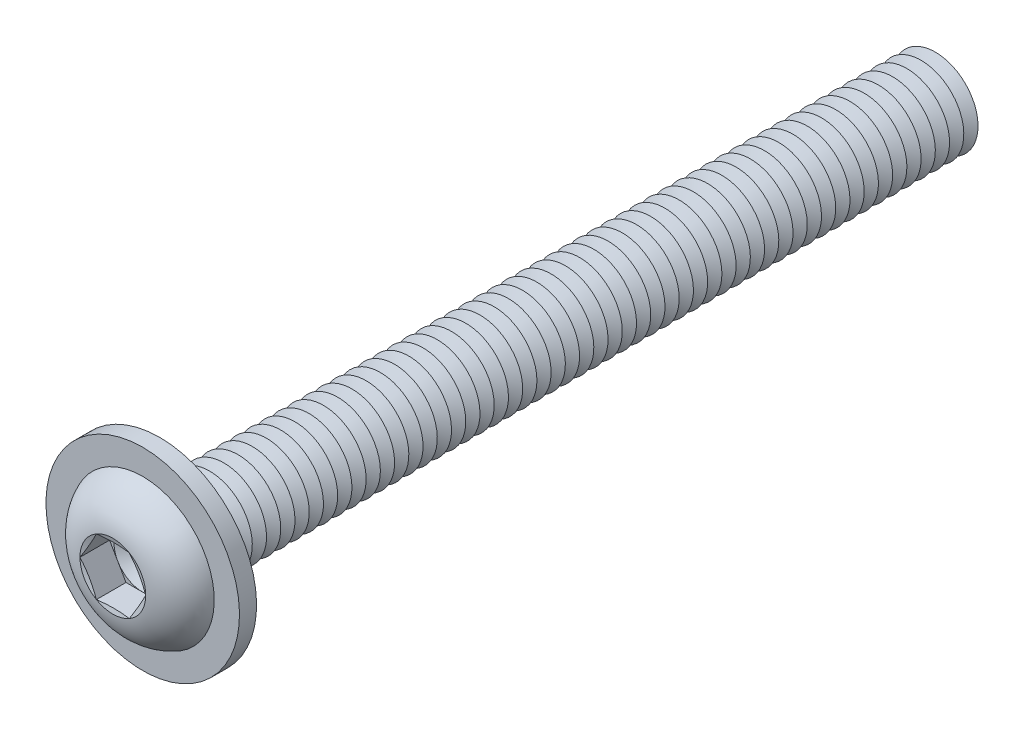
ISO-10303-21;
HEADER;
FILE_DESCRIPTION(('STEP AP214'),'2;1');
FILE_NAME('part.step','',(''),(''),'','','');
FILE_SCHEMA(('AUTOMOTIVE_DESIGN { 1 0 10303 214 1 1 1 1 }'));
ENDSEC;
DATA;
#1=APPLICATION_CONTEXT('core data for automotive mechanical design processes');
#2=APPLICATION_PROTOCOL_DEFINITION('international standard','automotive_design',2000,#1);
#3=PRODUCT_CONTEXT('',#1,'mechanical');
#4=PRODUCT('Part','Part','',(#3));
#5=PRODUCT_RELATED_PRODUCT_CATEGORY('part','',(#4));
#6=PRODUCT_DEFINITION_FORMATION('','',#4);
#7=PRODUCT_DEFINITION_CONTEXT('part definition',#1,'design');
#8=PRODUCT_DEFINITION('design','',#6,#7);
#9=PRODUCT_DEFINITION_SHAPE('','',#8);
#10=(LENGTH_UNIT() NAMED_UNIT(*) SI_UNIT(.MILLI.,.METRE.));
#11=(NAMED_UNIT(*) PLANE_ANGLE_UNIT() SI_UNIT($,.RADIAN.));
#12=(NAMED_UNIT(*) SI_UNIT($,.STERADIAN.) SOLID_ANGLE_UNIT());
#13=UNCERTAINTY_MEASURE_WITH_UNIT(LENGTH_MEASURE(1.E-05),#10,'distance_accuracy_value','');
#14=(GEOMETRIC_REPRESENTATION_CONTEXT(3) GLOBAL_UNCERTAINTY_ASSIGNED_CONTEXT((#13)) GLOBAL_UNIT_ASSIGNED_CONTEXT((#10,
#11,#12)) REPRESENTATION_CONTEXT('',''));
#15=CARTESIAN_POINT('',(0.,0.,0.));
#16=DIRECTION('',(0.,0.,1.));
#17=DIRECTION('',(1.,0.,0.));
#18=AXIS2_PLACEMENT_3D('',#15,#16,#17);
#19=CARTESIAN_POINT('',(0.,0.,-51.5));
#20=DIRECTION('',(0.,0.,1.));
#21=DIRECTION('',(0.,-1.,0.));
#22=AXIS2_PLACEMENT_3D('',#19,#20,#21);
#23=CONICAL_SURFACE('',#22,2.99999999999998,1.0471975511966);
#24=CARTESIAN_POINT('',(0.,0.,-52.));
#25=DIRECTION('',(0.,0.,1.));
#26=DIRECTION('',(0.,-1.,0.));
#27=AXIS2_PLACEMENT_3D('',#24,#25,#26);
#28=CIRCLE('',#27,2.13397459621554);
#29=CARTESIAN_POINT('',(0.,-2.13397459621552,-52.));
#30=VERTEX_POINT('',#29);
#31=EDGE_CURVE('E648',#30,#30,#28,.T.);
#32=ORIENTED_EDGE('',*,*,#31,.T.);
#33=EDGE_LOOP('',(#32));
#34=FACE_BOUND('',#33,.T.);
#35=CARTESIAN_POINT('',(0.,0.,-51.5));
#36=DIRECTION('',(0.,0.,1.));
#37=DIRECTION('',(0.,-1.,0.));
#38=AXIS2_PLACEMENT_3D('',#35,#36,#37);
#39=CIRCLE('',#38,2.99999999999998);
#40=CARTESIAN_POINT('',(0.,-2.99999999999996,-51.5));
#41=VERTEX_POINT('',#40);
#42=EDGE_CURVE('E645',#41,#41,#39,.T.);
#43=ORIENTED_EDGE('',*,*,#42,.F.);
#44=EDGE_LOOP('',(#43));
#45=FACE_BOUND('',#44,.T.);
#46=ADVANCED_FACE('F39',(#34,#45),#23,.T.);
#47=CARTESIAN_POINT('',(0.,0.,-52.));
#48=DIRECTION('',(0.,0.,-1.));
#49=DIRECTION('',(0.,1.,0.));
#50=AXIS2_PLACEMENT_3D('',#47,#48,#49);
#51=CONICAL_SURFACE('',#50,2.13397459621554,1.0471975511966);
#52=CARTESIAN_POINT('',(0.,0.,-52.5));
#53=DIRECTION('',(0.,0.,1.));
#54=DIRECTION('',(0.,-1.,0.));
#55=AXIS2_PLACEMENT_3D('',#52,#53,#54);
#56=CIRCLE('',#55,2.99999999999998);
#57=CARTESIAN_POINT('',(0.,-2.99999999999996,-52.5));
#58=VERTEX_POINT('',#57);
#59=EDGE_CURVE('E652',#58,#58,#56,.T.);
#60=ORIENTED_EDGE('',*,*,#59,.T.);
#61=EDGE_LOOP('',(#60));
#62=FACE_BOUND('',#61,.T.);
#63=ORIENTED_EDGE('',*,*,#31,.F.);
#64=EDGE_LOOP('',(#63));
#65=FACE_BOUND('',#64,.T.);
#66=ADVANCED_FACE('F770',(#62,#65),#51,.T.);
#67=CARTESIAN_POINT('',(0.,2.99999999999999,-55.));
#68=DIRECTION('',(0.,0.,-1.));
#69=DIRECTION('',(0.,1.,0.));
#70=AXIS2_PLACEMENT_3D('',#67,#68,#69);
#71=PLANE('',#70);
#72=CARTESIAN_POINT('',(0.,0.,-55.));
#73=DIRECTION('',(0.,0.,1.));
#74=DIRECTION('',(0.,-1.,0.));
#75=AXIS2_PLACEMENT_3D('',#72,#73,#74);
#76=CIRCLE('',#75,2.13397459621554);
#77=CARTESIAN_POINT('',(0.,-2.13397459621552,-55.));
#78=VERTEX_POINT('',#77);
#79=EDGE_CURVE('E672',#78,#78,#76,.T.);
#80=ORIENTED_EDGE('',*,*,#79,.F.);
#81=EDGE_LOOP('',(#80));
#82=FACE_BOUND('',#81,.T.);
#83=ADVANCED_FACE('F776',(#82),#71,.T.);
#84=CARTESIAN_POINT('',(0.,0.,-54.5));
#85=DIRECTION('',(0.,0.,1.));
#86=DIRECTION('',(0.,-1.,0.));
#87=AXIS2_PLACEMENT_3D('',#84,#85,#86);
#88=CONICAL_SURFACE('',#87,2.99999999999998,1.0471975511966);
#89=ORIENTED_EDGE('',*,*,#79,.T.);
#90=EDGE_LOOP('',(#89));
#91=FACE_BOUND('',#90,.T.);
#92=CARTESIAN_POINT('',(0.,0.,-54.5));
#93=DIRECTION('',(0.,0.,1.));
#94=DIRECTION('',(0.,-1.,0.));
#95=AXIS2_PLACEMENT_3D('',#92,#93,#94);
#96=CIRCLE('',#95,2.99999999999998);
#97=CARTESIAN_POINT('',(0.,-2.99999999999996,-54.5));
#98=VERTEX_POINT('',#97);
#99=EDGE_CURVE('E668',#98,#98,#96,.T.);
#100=ORIENTED_EDGE('',*,*,#99,.F.);
#101=EDGE_LOOP('',(#100));
#102=FACE_BOUND('',#101,.T.);
#103=ADVANCED_FACE('F795',(#91,#102),#88,.T.);
#104=CARTESIAN_POINT('',(0.,0.,-54.));
#105=DIRECTION('',(0.,0.,-1.));
#106=DIRECTION('',(0.,1.,0.));
#107=AXIS2_PLACEMENT_3D('',#104,#105,#106);
#108=CONICAL_SURFACE('',#107,2.13397459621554,1.0471975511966);
#109=ORIENTED_EDGE('',*,*,#99,.T.);
#110=EDGE_LOOP('',(#109));
#111=FACE_BOUND('',#110,.T.);
#112=CARTESIAN_POINT('',(0.,0.,-54.));
#113=DIRECTION('',(0.,0.,1.));
#114=DIRECTION('',(0.,-1.,0.));
#115=AXIS2_PLACEMENT_3D('',#112,#113,#114);
#116=CIRCLE('',#115,2.13397459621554);
#117=CARTESIAN_POINT('',(0.,-2.13397459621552,-54.));
#118=VERTEX_POINT('',#117);
#119=EDGE_CURVE('E664',#118,#118,#116,.T.);
#120=ORIENTED_EDGE('',*,*,#119,.F.);
#121=EDGE_LOOP('',(#120));
#122=FACE_BOUND('',#121,.T.);
#123=ADVANCED_FACE('F792',(#111,#122),#108,.T.);
#124=CARTESIAN_POINT('',(0.,0.,-53.5));
#125=DIRECTION('',(0.,0.,1.));
#126=DIRECTION('',(0.,-1.,0.));
#127=AXIS2_PLACEMENT_3D('',#124,#125,#126);
#128=CONICAL_SURFACE('',#127,2.99999999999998,1.0471975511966);
#129=ORIENTED_EDGE('',*,*,#119,.T.);
#130=EDGE_LOOP('',(#129));
#131=FACE_BOUND('',#130,.T.);
#132=CARTESIAN_POINT('',(0.,0.,-53.5));
#133=DIRECTION('',(0.,0.,1.));
#134=DIRECTION('',(0.,-1.,0.));
#135=AXIS2_PLACEMENT_3D('',#132,#133,#134);
#136=CIRCLE('',#135,2.99999999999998);
#137=CARTESIAN_POINT('',(0.,-2.99999999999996,-53.5));
#138=VERTEX_POINT('',#137);
#139=EDGE_CURVE('E660',#138,#138,#136,.T.);
#140=ORIENTED_EDGE('',*,*,#139,.F.);
#141=EDGE_LOOP('',(#140));
#142=FACE_BOUND('',#141,.T.);
#143=ADVANCED_FACE('F786',(#131,#142),#128,.T.);
#144=CARTESIAN_POINT('',(0.,0.,-53.));
#145=DIRECTION('',(0.,0.,-1.));
#146=DIRECTION('',(0.,1.,0.));
#147=AXIS2_PLACEMENT_3D('',#144,#145,#146);
#148=CONICAL_SURFACE('',#147,2.13397459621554,1.0471975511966);
#149=ORIENTED_EDGE('',*,*,#139,.T.);
#150=EDGE_LOOP('',(#149));
#151=FACE_BOUND('',#150,.T.);
#152=CARTESIAN_POINT('',(0.,0.,-53.));
#153=DIRECTION('',(0.,0.,1.));
#154=DIRECTION('',(0.,-1.,0.));
#155=AXIS2_PLACEMENT_3D('',#152,#153,#154);
#156=CIRCLE('',#155,2.13397459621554);
#157=CARTESIAN_POINT('',(0.,-2.13397459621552,-53.));
#158=VERTEX_POINT('',#157);
#159=EDGE_CURVE('E656',#158,#158,#156,.T.);
#160=ORIENTED_EDGE('',*,*,#159,.F.);
#161=EDGE_LOOP('',(#160));
#162=FACE_BOUND('',#161,.T.);
#163=ADVANCED_FACE('F782',(#151,#162),#148,.T.);
#164=CARTESIAN_POINT('',(0.,0.,-52.5));
#165=DIRECTION('',(0.,0.,1.));
#166=DIRECTION('',(0.,-1.,0.));
#167=AXIS2_PLACEMENT_3D('',#164,#165,#166);
#168=CONICAL_SURFACE('',#167,2.99999999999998,1.0471975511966);
#169=ORIENTED_EDGE('',*,*,#159,.T.);
#170=EDGE_LOOP('',(#169));
#171=FACE_BOUND('',#170,.T.);
#172=ORIENTED_EDGE('',*,*,#59,.F.);
#173=EDGE_LOOP('',(#172));
#174=FACE_BOUND('',#173,.T.);
#175=ADVANCED_FACE('F785',(#171,#174),#168,.T.);
#176=CARTESIAN_POINT('',(0.,0.,-50.5));
#177=DIRECTION('',(0.,0.,1.));
#178=DIRECTION('',(0.,-1.,0.));
#179=AXIS2_PLACEMENT_3D('',#176,#177,#178);
#180=CONICAL_SURFACE('',#179,2.99999999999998,1.0471975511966);
#181=CARTESIAN_POINT('',(0.,0.,-51.));
#182=DIRECTION('',(0.,0.,1.));
#183=DIRECTION('',(0.,-1.,0.));
#184=AXIS2_PLACEMENT_3D('',#181,#182,#183);
#185=CIRCLE('',#184,2.13397459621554);
#186=CARTESIAN_POINT('',(0.,-2.13397459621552,-51.));
#187=VERTEX_POINT('',#186);
#188=EDGE_CURVE('E641',#187,#187,#185,.T.);
#189=ORIENTED_EDGE('',*,*,#188,.T.);
#190=EDGE_LOOP('',(#189));
#191=FACE_BOUND('',#190,.T.);
#192=CARTESIAN_POINT('',(0.,0.,-50.5));
#193=DIRECTION('',(0.,0.,1.));
#194=DIRECTION('',(0.,-1.,0.));
#195=AXIS2_PLACEMENT_3D('',#192,#193,#194);
#196=CIRCLE('',#195,2.99999999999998);
#197=CARTESIAN_POINT('',(0.,-2.99999999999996,-50.5));
#198=VERTEX_POINT('',#197);
#199=EDGE_CURVE('E637',#198,#198,#196,.T.);
#200=ORIENTED_EDGE('',*,*,#199,.F.);
#201=EDGE_LOOP('',(#200));
#202=FACE_BOUND('',#201,.T.);
#203=ADVANCED_FACE('F790',(#191,#202),#180,.T.);
#204=CARTESIAN_POINT('',(0.,0.,-51.));
#205=DIRECTION('',(0.,0.,-1.));
#206=DIRECTION('',(0.,1.,0.));
#207=AXIS2_PLACEMENT_3D('',#204,#205,#206);
#208=CONICAL_SURFACE('',#207,2.13397459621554,1.0471975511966);
#209=ORIENTED_EDGE('',*,*,#42,.T.);
#210=EDGE_LOOP('',(#209));
#211=FACE_BOUND('',#210,.T.);
#212=ORIENTED_EDGE('',*,*,#188,.F.);
#213=EDGE_LOOP('',(#212));
#214=FACE_BOUND('',#213,.T.);
#215=ADVANCED_FACE('F841',(#211,#214),#208,.T.);
#216=CARTESIAN_POINT('',(0.,0.,-49.5));
#217=DIRECTION('',(0.,0.,1.));
#218=DIRECTION('',(0.,-1.,0.));
#219=AXIS2_PLACEMENT_3D('',#216,#217,#218);
#220=CONICAL_SURFACE('',#219,2.99999999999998,1.0471975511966);
#221=CARTESIAN_POINT('',(0.,0.,-50.));
#222=DIRECTION('',(0.,0.,1.));
#223=DIRECTION('',(0.,-1.,0.));
#224=AXIS2_PLACEMENT_3D('',#221,#222,#223);
#225=CIRCLE('',#224,2.13397459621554);
#226=CARTESIAN_POINT('',(0.,-2.13397459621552,-50.));
#227=VERTEX_POINT('',#226);
#228=EDGE_CURVE('E633',#227,#227,#225,.T.);
#229=ORIENTED_EDGE('',*,*,#228,.T.);
#230=EDGE_LOOP('',(#229));
#231=FACE_BOUND('',#230,.T.);
#232=CARTESIAN_POINT('',(0.,0.,-49.5));
#233=DIRECTION('',(0.,0.,1.));
#234=DIRECTION('',(0.,-1.,0.));
#235=AXIS2_PLACEMENT_3D('',#232,#233,#234);
#236=CIRCLE('',#235,2.99999999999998);
#237=CARTESIAN_POINT('',(0.,-2.99999999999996,-49.5));
#238=VERTEX_POINT('',#237);
#239=EDGE_CURVE('E629',#238,#238,#236,.T.);
#240=ORIENTED_EDGE('',*,*,#239,.F.);
#241=EDGE_LOOP('',(#240));
#242=FACE_BOUND('',#241,.T.);
#243=ADVANCED_FACE('F847',(#231,#242),#220,.T.);
#244=CARTESIAN_POINT('',(0.,0.,-50.));
#245=DIRECTION('',(0.,0.,-1.));
#246=DIRECTION('',(0.,1.,0.));
#247=AXIS2_PLACEMENT_3D('',#244,#245,#246);
#248=CONICAL_SURFACE('',#247,2.13397459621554,1.0471975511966);
#249=ORIENTED_EDGE('',*,*,#199,.T.);
#250=EDGE_LOOP('',(#249));
#251=FACE_BOUND('',#250,.T.);
#252=ORIENTED_EDGE('',*,*,#228,.F.);
#253=EDGE_LOOP('',(#252));
#254=FACE_BOUND('',#253,.T.);
#255=ADVANCED_FACE('F854',(#251,#254),#248,.T.);
#256=CARTESIAN_POINT('',(0.,0.,-48.5));
#257=DIRECTION('',(0.,0.,1.));
#258=DIRECTION('',(0.,-1.,0.));
#259=AXIS2_PLACEMENT_3D('',#256,#257,#258);
#260=CONICAL_SURFACE('',#259,2.99999999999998,1.0471975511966);
#261=CARTESIAN_POINT('',(0.,0.,-49.));
#262=DIRECTION('',(0.,0.,1.));
#263=DIRECTION('',(0.,-1.,0.));
#264=AXIS2_PLACEMENT_3D('',#261,#262,#263);
#265=CIRCLE('',#264,2.13397459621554);
#266=CARTESIAN_POINT('',(0.,-2.13397459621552,-49.));
#267=VERTEX_POINT('',#266);
#268=EDGE_CURVE('E625',#267,#267,#265,.T.);
#269=ORIENTED_EDGE('',*,*,#268,.T.);
#270=EDGE_LOOP('',(#269));
#271=FACE_BOUND('',#270,.T.);
#272=CARTESIAN_POINT('',(0.,0.,-48.5));
#273=DIRECTION('',(0.,0.,1.));
#274=DIRECTION('',(0.,-1.,0.));
#275=AXIS2_PLACEMENT_3D('',#272,#273,#274);
#276=CIRCLE('',#275,2.99999999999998);
#277=CARTESIAN_POINT('',(0.,-2.99999999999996,-48.5));
#278=VERTEX_POINT('',#277);
#279=EDGE_CURVE('E621',#278,#278,#276,.T.);
#280=ORIENTED_EDGE('',*,*,#279,.F.);
#281=EDGE_LOOP('',(#280));
#282=FACE_BOUND('',#281,.T.);
#283=ADVANCED_FACE('F861',(#271,#282),#260,.T.);
#284=CARTESIAN_POINT('',(0.,0.,-49.));
#285=DIRECTION('',(0.,0.,-1.));
#286=DIRECTION('',(0.,1.,0.));
#287=AXIS2_PLACEMENT_3D('',#284,#285,#286);
#288=CONICAL_SURFACE('',#287,2.13397459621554,1.0471975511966);
#289=ORIENTED_EDGE('',*,*,#239,.T.);
#290=EDGE_LOOP('',(#289));
#291=FACE_BOUND('',#290,.T.);
#292=ORIENTED_EDGE('',*,*,#268,.F.);
#293=EDGE_LOOP('',(#292));
#294=FACE_BOUND('',#293,.T.);
#295=ADVANCED_FACE('F868',(#291,#294),#288,.T.);
#296=CARTESIAN_POINT('',(0.,0.,-47.5));
#297=DIRECTION('',(0.,0.,1.));
#298=DIRECTION('',(0.,-1.,0.));
#299=AXIS2_PLACEMENT_3D('',#296,#297,#298);
#300=CONICAL_SURFACE('',#299,2.99999999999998,1.0471975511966);
#301=CARTESIAN_POINT('',(0.,0.,-48.));
#302=DIRECTION('',(0.,0.,1.));
#303=DIRECTION('',(0.,-1.,0.));
#304=AXIS2_PLACEMENT_3D('',#301,#302,#303);
#305=CIRCLE('',#304,2.13397459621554);
#306=CARTESIAN_POINT('',(0.,-2.13397459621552,-48.));
#307=VERTEX_POINT('',#306);
#308=EDGE_CURVE('E617',#307,#307,#305,.T.);
#309=ORIENTED_EDGE('',*,*,#308,.T.);
#310=EDGE_LOOP('',(#309));
#311=FACE_BOUND('',#310,.T.);
#312=CARTESIAN_POINT('',(0.,0.,-47.5));
#313=DIRECTION('',(0.,0.,1.));
#314=DIRECTION('',(0.,-1.,0.));
#315=AXIS2_PLACEMENT_3D('',#312,#313,#314);
#316=CIRCLE('',#315,2.99999999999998);
#317=CARTESIAN_POINT('',(0.,-2.99999999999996,-47.5));
#318=VERTEX_POINT('',#317);
#319=EDGE_CURVE('E613',#318,#318,#316,.T.);
#320=ORIENTED_EDGE('',*,*,#319,.F.);
#321=EDGE_LOOP('',(#320));
#322=FACE_BOUND('',#321,.T.);
#323=ADVANCED_FACE('F875',(#311,#322),#300,.T.);
#324=CARTESIAN_POINT('',(0.,0.,-48.));
#325=DIRECTION('',(0.,0.,-1.));
#326=DIRECTION('',(0.,1.,0.));
#327=AXIS2_PLACEMENT_3D('',#324,#325,#326);
#328=CONICAL_SURFACE('',#327,2.13397459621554,1.0471975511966);
#329=ORIENTED_EDGE('',*,*,#279,.T.);
#330=EDGE_LOOP('',(#329));
#331=FACE_BOUND('',#330,.T.);
#332=ORIENTED_EDGE('',*,*,#308,.F.);
#333=EDGE_LOOP('',(#332));
#334=FACE_BOUND('',#333,.T.);
#335=ADVANCED_FACE('F882',(#331,#334),#328,.T.);
#336=CARTESIAN_POINT('',(0.,0.,-46.5));
#337=DIRECTION('',(0.,0.,1.));
#338=DIRECTION('',(0.,-1.,0.));
#339=AXIS2_PLACEMENT_3D('',#336,#337,#338);
#340=CONICAL_SURFACE('',#339,2.99999999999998,1.0471975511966);
#341=CARTESIAN_POINT('',(0.,0.,-47.));
#342=DIRECTION('',(0.,0.,1.));
#343=DIRECTION('',(0.,-1.,0.));
#344=AXIS2_PLACEMENT_3D('',#341,#342,#343);
#345=CIRCLE('',#344,2.13397459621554);
#346=CARTESIAN_POINT('',(0.,-2.13397459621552,-47.));
#347=VERTEX_POINT('',#346);
#348=EDGE_CURVE('E609',#347,#347,#345,.T.);
#349=ORIENTED_EDGE('',*,*,#348,.T.);
#350=EDGE_LOOP('',(#349));
#351=FACE_BOUND('',#350,.T.);
#352=CARTESIAN_POINT('',(0.,0.,-46.5));
#353=DIRECTION('',(0.,0.,1.));
#354=DIRECTION('',(0.,-1.,0.));
#355=AXIS2_PLACEMENT_3D('',#352,#353,#354);
#356=CIRCLE('',#355,2.99999999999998);
#357=CARTESIAN_POINT('',(0.,-2.99999999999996,-46.5));
#358=VERTEX_POINT('',#357);
#359=EDGE_CURVE('E605',#358,#358,#356,.T.);
#360=ORIENTED_EDGE('',*,*,#359,.F.);
#361=EDGE_LOOP('',(#360));
#362=FACE_BOUND('',#361,.T.);
#363=ADVANCED_FACE('F889',(#351,#362),#340,.T.);
#364=CARTESIAN_POINT('',(0.,0.,-47.));
#365=DIRECTION('',(0.,0.,-1.));
#366=DIRECTION('',(0.,1.,0.));
#367=AXIS2_PLACEMENT_3D('',#364,#365,#366);
#368=CONICAL_SURFACE('',#367,2.13397459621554,1.0471975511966);
#369=ORIENTED_EDGE('',*,*,#319,.T.);
#370=EDGE_LOOP('',(#369));
#371=FACE_BOUND('',#370,.T.);
#372=ORIENTED_EDGE('',*,*,#348,.F.);
#373=EDGE_LOOP('',(#372));
#374=FACE_BOUND('',#373,.T.);
#375=ADVANCED_FACE('F896',(#371,#374),#368,.T.);
#376=CARTESIAN_POINT('',(0.,0.,-45.5));
#377=DIRECTION('',(0.,0.,1.));
#378=DIRECTION('',(0.,-1.,0.));
#379=AXIS2_PLACEMENT_3D('',#376,#377,#378);
#380=CONICAL_SURFACE('',#379,2.99999999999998,1.0471975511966);
#381=CARTESIAN_POINT('',(0.,0.,-46.));
#382=DIRECTION('',(0.,0.,1.));
#383=DIRECTION('',(0.,-1.,0.));
#384=AXIS2_PLACEMENT_3D('',#381,#382,#383);
#385=CIRCLE('',#384,2.13397459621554);
#386=CARTESIAN_POINT('',(0.,-2.13397459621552,-46.));
#387=VERTEX_POINT('',#386);
#388=EDGE_CURVE('E601',#387,#387,#385,.T.);
#389=ORIENTED_EDGE('',*,*,#388,.T.);
#390=EDGE_LOOP('',(#389));
#391=FACE_BOUND('',#390,.T.);
#392=CARTESIAN_POINT('',(0.,0.,-45.5));
#393=DIRECTION('',(0.,0.,1.));
#394=DIRECTION('',(0.,-1.,0.));
#395=AXIS2_PLACEMENT_3D('',#392,#393,#394);
#396=CIRCLE('',#395,2.99999999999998);
#397=CARTESIAN_POINT('',(0.,-2.99999999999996,-45.5));
#398=VERTEX_POINT('',#397);
#399=EDGE_CURVE('E597',#398,#398,#396,.T.);
#400=ORIENTED_EDGE('',*,*,#399,.F.);
#401=EDGE_LOOP('',(#400));
#402=FACE_BOUND('',#401,.T.);
#403=ADVANCED_FACE('F903',(#391,#402),#380,.T.);
#404=CARTESIAN_POINT('',(0.,0.,-46.));
#405=DIRECTION('',(0.,0.,-1.));
#406=DIRECTION('',(0.,1.,0.));
#407=AXIS2_PLACEMENT_3D('',#404,#405,#406);
#408=CONICAL_SURFACE('',#407,2.13397459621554,1.0471975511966);
#409=ORIENTED_EDGE('',*,*,#359,.T.);
#410=EDGE_LOOP('',(#409));
#411=FACE_BOUND('',#410,.T.);
#412=ORIENTED_EDGE('',*,*,#388,.F.);
#413=EDGE_LOOP('',(#412));
#414=FACE_BOUND('',#413,.T.);
#415=ADVANCED_FACE('F910',(#411,#414),#408,.T.);
#416=CARTESIAN_POINT('',(0.,0.,-44.5));
#417=DIRECTION('',(0.,0.,1.));
#418=DIRECTION('',(0.,-1.,0.));
#419=AXIS2_PLACEMENT_3D('',#416,#417,#418);
#420=CONICAL_SURFACE('',#419,2.99999999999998,1.0471975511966);
#421=CARTESIAN_POINT('',(0.,0.,-45.));
#422=DIRECTION('',(0.,0.,1.));
#423=DIRECTION('',(0.,-1.,0.));
#424=AXIS2_PLACEMENT_3D('',#421,#422,#423);
#425=CIRCLE('',#424,2.13397459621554);
#426=CARTESIAN_POINT('',(0.,-2.13397459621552,-45.));
#427=VERTEX_POINT('',#426);
#428=EDGE_CURVE('E593',#427,#427,#425,.T.);
#429=ORIENTED_EDGE('',*,*,#428,.T.);
#430=EDGE_LOOP('',(#429));
#431=FACE_BOUND('',#430,.T.);
#432=CARTESIAN_POINT('',(0.,0.,-44.5));
#433=DIRECTION('',(0.,0.,1.));
#434=DIRECTION('',(0.,-1.,0.));
#435=AXIS2_PLACEMENT_3D('',#432,#433,#434);
#436=CIRCLE('',#435,2.99999999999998);
#437=CARTESIAN_POINT('',(0.,-2.99999999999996,-44.5));
#438=VERTEX_POINT('',#437);
#439=EDGE_CURVE('E589',#438,#438,#436,.T.);
#440=ORIENTED_EDGE('',*,*,#439,.F.);
#441=EDGE_LOOP('',(#440));
#442=FACE_BOUND('',#441,.T.);
#443=ADVANCED_FACE('F917',(#431,#442),#420,.T.);
#444=CARTESIAN_POINT('',(0.,0.,-45.));
#445=DIRECTION('',(0.,0.,-1.));
#446=DIRECTION('',(0.,1.,0.));
#447=AXIS2_PLACEMENT_3D('',#444,#445,#446);
#448=CONICAL_SURFACE('',#447,2.13397459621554,1.0471975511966);
#449=ORIENTED_EDGE('',*,*,#399,.T.);
#450=EDGE_LOOP('',(#449));
#451=FACE_BOUND('',#450,.T.);
#452=ORIENTED_EDGE('',*,*,#428,.F.);
#453=EDGE_LOOP('',(#452));
#454=FACE_BOUND('',#453,.T.);
#455=ADVANCED_FACE('F924',(#451,#454),#448,.T.);
#456=CARTESIAN_POINT('',(0.,0.,-43.5));
#457=DIRECTION('',(0.,0.,1.));
#458=DIRECTION('',(0.,-1.,0.));
#459=AXIS2_PLACEMENT_3D('',#456,#457,#458);
#460=CONICAL_SURFACE('',#459,2.99999999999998,1.0471975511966);
#461=CARTESIAN_POINT('',(0.,0.,-44.));
#462=DIRECTION('',(0.,0.,1.));
#463=DIRECTION('',(0.,-1.,0.));
#464=AXIS2_PLACEMENT_3D('',#461,#462,#463);
#465=CIRCLE('',#464,2.13397459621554);
#466=CARTESIAN_POINT('',(0.,-2.13397459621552,-44.));
#467=VERTEX_POINT('',#466);
#468=EDGE_CURVE('E585',#467,#467,#465,.T.);
#469=ORIENTED_EDGE('',*,*,#468,.T.);
#470=EDGE_LOOP('',(#469));
#471=FACE_BOUND('',#470,.T.);
#472=CARTESIAN_POINT('',(0.,0.,-43.5));
#473=DIRECTION('',(0.,0.,1.));
#474=DIRECTION('',(0.,-1.,0.));
#475=AXIS2_PLACEMENT_3D('',#472,#473,#474);
#476=CIRCLE('',#475,2.99999999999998);
#477=CARTESIAN_POINT('',(0.,-2.99999999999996,-43.5));
#478=VERTEX_POINT('',#477);
#479=EDGE_CURVE('E581',#478,#478,#476,.T.);
#480=ORIENTED_EDGE('',*,*,#479,.F.);
#481=EDGE_LOOP('',(#480));
#482=FACE_BOUND('',#481,.T.);
#483=ADVANCED_FACE('F931',(#471,#482),#460,.T.);
#484=CARTESIAN_POINT('',(0.,0.,-44.));
#485=DIRECTION('',(0.,0.,-1.));
#486=DIRECTION('',(0.,1.,0.));
#487=AXIS2_PLACEMENT_3D('',#484,#485,#486);
#488=CONICAL_SURFACE('',#487,2.13397459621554,1.0471975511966);
#489=ORIENTED_EDGE('',*,*,#439,.T.);
#490=EDGE_LOOP('',(#489));
#491=FACE_BOUND('',#490,.T.);
#492=ORIENTED_EDGE('',*,*,#468,.F.);
#493=EDGE_LOOP('',(#492));
#494=FACE_BOUND('',#493,.T.);
#495=ADVANCED_FACE('F938',(#491,#494),#488,.T.);
#496=CARTESIAN_POINT('',(0.,0.,-42.5));
#497=DIRECTION('',(0.,0.,1.));
#498=DIRECTION('',(0.,-1.,0.));
#499=AXIS2_PLACEMENT_3D('',#496,#497,#498);
#500=CONICAL_SURFACE('',#499,2.99999999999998,1.0471975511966);
#501=CARTESIAN_POINT('',(0.,0.,-43.));
#502=DIRECTION('',(0.,0.,1.));
#503=DIRECTION('',(0.,-1.,0.));
#504=AXIS2_PLACEMENT_3D('',#501,#502,#503);
#505=CIRCLE('',#504,2.13397459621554);
#506=CARTESIAN_POINT('',(0.,-2.13397459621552,-43.));
#507=VERTEX_POINT('',#506);
#508=EDGE_CURVE('E577',#507,#507,#505,.T.);
#509=ORIENTED_EDGE('',*,*,#508,.T.);
#510=EDGE_LOOP('',(#509));
#511=FACE_BOUND('',#510,.T.);
#512=CARTESIAN_POINT('',(0.,0.,-42.5));
#513=DIRECTION('',(0.,0.,1.));
#514=DIRECTION('',(0.,-1.,0.));
#515=AXIS2_PLACEMENT_3D('',#512,#513,#514);
#516=CIRCLE('',#515,2.99999999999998);
#517=CARTESIAN_POINT('',(0.,-2.99999999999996,-42.5));
#518=VERTEX_POINT('',#517);
#519=EDGE_CURVE('E573',#518,#518,#516,.T.);
#520=ORIENTED_EDGE('',*,*,#519,.F.);
#521=EDGE_LOOP('',(#520));
#522=FACE_BOUND('',#521,.T.);
#523=ADVANCED_FACE('F945',(#511,#522),#500,.T.);
#524=CARTESIAN_POINT('',(0.,0.,-43.));
#525=DIRECTION('',(0.,0.,-1.));
#526=DIRECTION('',(0.,1.,0.));
#527=AXIS2_PLACEMENT_3D('',#524,#525,#526);
#528=CONICAL_SURFACE('',#527,2.13397459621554,1.0471975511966);
#529=ORIENTED_EDGE('',*,*,#479,.T.);
#530=EDGE_LOOP('',(#529));
#531=FACE_BOUND('',#530,.T.);
#532=ORIENTED_EDGE('',*,*,#508,.F.);
#533=EDGE_LOOP('',(#532));
#534=FACE_BOUND('',#533,.T.);
#535=ADVANCED_FACE('F952',(#531,#534),#528,.T.);
#536=CARTESIAN_POINT('',(0.,0.,-41.5));
#537=DIRECTION('',(0.,0.,1.));
#538=DIRECTION('',(0.,-1.,0.));
#539=AXIS2_PLACEMENT_3D('',#536,#537,#538);
#540=CONICAL_SURFACE('',#539,2.99999999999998,1.0471975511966);
#541=CARTESIAN_POINT('',(0.,0.,-42.));
#542=DIRECTION('',(0.,0.,1.));
#543=DIRECTION('',(0.,-1.,0.));
#544=AXIS2_PLACEMENT_3D('',#541,#542,#543);
#545=CIRCLE('',#544,2.13397459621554);
#546=CARTESIAN_POINT('',(0.,-2.13397459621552,-42.));
#547=VERTEX_POINT('',#546);
#548=EDGE_CURVE('E569',#547,#547,#545,.T.);
#549=ORIENTED_EDGE('',*,*,#548,.T.);
#550=EDGE_LOOP('',(#549));
#551=FACE_BOUND('',#550,.T.);
#552=CARTESIAN_POINT('',(0.,0.,-41.5));
#553=DIRECTION('',(0.,0.,1.));
#554=DIRECTION('',(0.,-1.,0.));
#555=AXIS2_PLACEMENT_3D('',#552,#553,#554);
#556=CIRCLE('',#555,2.99999999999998);
#557=CARTESIAN_POINT('',(0.,-2.99999999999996,-41.5));
#558=VERTEX_POINT('',#557);
#559=EDGE_CURVE('E565',#558,#558,#556,.T.);
#560=ORIENTED_EDGE('',*,*,#559,.F.);
#561=EDGE_LOOP('',(#560));
#562=FACE_BOUND('',#561,.T.);
#563=ADVANCED_FACE('F959',(#551,#562),#540,.T.);
#564=CARTESIAN_POINT('',(0.,0.,-42.));
#565=DIRECTION('',(0.,0.,-1.));
#566=DIRECTION('',(0.,1.,0.));
#567=AXIS2_PLACEMENT_3D('',#564,#565,#566);
#568=CONICAL_SURFACE('',#567,2.13397459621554,1.0471975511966);
#569=ORIENTED_EDGE('',*,*,#519,.T.);
#570=EDGE_LOOP('',(#569));
#571=FACE_BOUND('',#570,.T.);
#572=ORIENTED_EDGE('',*,*,#548,.F.);
#573=EDGE_LOOP('',(#572));
#574=FACE_BOUND('',#573,.T.);
#575=ADVANCED_FACE('F966',(#571,#574),#568,.T.);
#576=CARTESIAN_POINT('',(0.,0.,-40.5));
#577=DIRECTION('',(0.,0.,1.));
#578=DIRECTION('',(0.,-1.,0.));
#579=AXIS2_PLACEMENT_3D('',#576,#577,#578);
#580=CONICAL_SURFACE('',#579,2.99999999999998,1.0471975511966);
#581=CARTESIAN_POINT('',(0.,0.,-41.));
#582=DIRECTION('',(0.,0.,1.));
#583=DIRECTION('',(0.,-1.,0.));
#584=AXIS2_PLACEMENT_3D('',#581,#582,#583);
#585=CIRCLE('',#584,2.13397459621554);
#586=CARTESIAN_POINT('',(0.,-2.13397459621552,-41.));
#587=VERTEX_POINT('',#586);
#588=EDGE_CURVE('E561',#587,#587,#585,.T.);
#589=ORIENTED_EDGE('',*,*,#588,.T.);
#590=EDGE_LOOP('',(#589));
#591=FACE_BOUND('',#590,.T.);
#592=CARTESIAN_POINT('',(0.,0.,-40.5));
#593=DIRECTION('',(0.,0.,1.));
#594=DIRECTION('',(0.,-1.,0.));
#595=AXIS2_PLACEMENT_3D('',#592,#593,#594);
#596=CIRCLE('',#595,2.99999999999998);
#597=CARTESIAN_POINT('',(0.,-2.99999999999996,-40.5));
#598=VERTEX_POINT('',#597);
#599=EDGE_CURVE('E557',#598,#598,#596,.T.);
#600=ORIENTED_EDGE('',*,*,#599,.F.);
#601=EDGE_LOOP('',(#600));
#602=FACE_BOUND('',#601,.T.);
#603=ADVANCED_FACE('F973',(#591,#602),#580,.T.);
#604=CARTESIAN_POINT('',(0.,0.,-41.));
#605=DIRECTION('',(0.,0.,-1.));
#606=DIRECTION('',(0.,1.,0.));
#607=AXIS2_PLACEMENT_3D('',#604,#605,#606);
#608=CONICAL_SURFACE('',#607,2.13397459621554,1.0471975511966);
#609=ORIENTED_EDGE('',*,*,#559,.T.);
#610=EDGE_LOOP('',(#609));
#611=FACE_BOUND('',#610,.T.);
#612=ORIENTED_EDGE('',*,*,#588,.F.);
#613=EDGE_LOOP('',(#612));
#614=FACE_BOUND('',#613,.T.);
#615=ADVANCED_FACE('F980',(#611,#614),#608,.T.);
#616=CARTESIAN_POINT('',(0.,0.,-39.5));
#617=DIRECTION('',(0.,0.,1.));
#618=DIRECTION('',(0.,-1.,0.));
#619=AXIS2_PLACEMENT_3D('',#616,#617,#618);
#620=CONICAL_SURFACE('',#619,2.99999999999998,1.0471975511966);
#621=CARTESIAN_POINT('',(0.,0.,-40.));
#622=DIRECTION('',(0.,0.,1.));
#623=DIRECTION('',(0.,-1.,0.));
#624=AXIS2_PLACEMENT_3D('',#621,#622,#623);
#625=CIRCLE('',#624,2.13397459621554);
#626=CARTESIAN_POINT('',(0.,-2.13397459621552,-40.));
#627=VERTEX_POINT('',#626);
#628=EDGE_CURVE('E553',#627,#627,#625,.T.);
#629=ORIENTED_EDGE('',*,*,#628,.T.);
#630=EDGE_LOOP('',(#629));
#631=FACE_BOUND('',#630,.T.);
#632=CARTESIAN_POINT('',(0.,0.,-39.5));
#633=DIRECTION('',(0.,0.,1.));
#634=DIRECTION('',(0.,-1.,0.));
#635=AXIS2_PLACEMENT_3D('',#632,#633,#634);
#636=CIRCLE('',#635,2.99999999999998);
#637=CARTESIAN_POINT('',(0.,-2.99999999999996,-39.5));
#638=VERTEX_POINT('',#637);
#639=EDGE_CURVE('E549',#638,#638,#636,.T.);
#640=ORIENTED_EDGE('',*,*,#639,.F.);
#641=EDGE_LOOP('',(#640));
#642=FACE_BOUND('',#641,.T.);
#643=ADVANCED_FACE('F987',(#631,#642),#620,.T.);
#644=CARTESIAN_POINT('',(0.,0.,-40.));
#645=DIRECTION('',(0.,0.,-1.));
#646=DIRECTION('',(0.,1.,0.));
#647=AXIS2_PLACEMENT_3D('',#644,#645,#646);
#648=CONICAL_SURFACE('',#647,2.13397459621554,1.0471975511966);
#649=ORIENTED_EDGE('',*,*,#599,.T.);
#650=EDGE_LOOP('',(#649));
#651=FACE_BOUND('',#650,.T.);
#652=ORIENTED_EDGE('',*,*,#628,.F.);
#653=EDGE_LOOP('',(#652));
#654=FACE_BOUND('',#653,.T.);
#655=ADVANCED_FACE('F994',(#651,#654),#648,.T.);
#656=CARTESIAN_POINT('',(0.,0.,-38.5));
#657=DIRECTION('',(0.,0.,1.));
#658=DIRECTION('',(0.,-1.,0.));
#659=AXIS2_PLACEMENT_3D('',#656,#657,#658);
#660=CONICAL_SURFACE('',#659,2.99999999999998,1.0471975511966);
#661=CARTESIAN_POINT('',(0.,0.,-39.));
#662=DIRECTION('',(0.,0.,1.));
#663=DIRECTION('',(0.,-1.,0.));
#664=AXIS2_PLACEMENT_3D('',#661,#662,#663);
#665=CIRCLE('',#664,2.13397459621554);
#666=CARTESIAN_POINT('',(0.,-2.13397459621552,-39.));
#667=VERTEX_POINT('',#666);
#668=EDGE_CURVE('E545',#667,#667,#665,.T.);
#669=ORIENTED_EDGE('',*,*,#668,.T.);
#670=EDGE_LOOP('',(#669));
#671=FACE_BOUND('',#670,.T.);
#672=CARTESIAN_POINT('',(0.,0.,-38.5));
#673=DIRECTION('',(0.,0.,1.));
#674=DIRECTION('',(0.,-1.,0.));
#675=AXIS2_PLACEMENT_3D('',#672,#673,#674);
#676=CIRCLE('',#675,2.99999999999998);
#677=CARTESIAN_POINT('',(0.,-2.99999999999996,-38.5));
#678=VERTEX_POINT('',#677);
#679=EDGE_CURVE('E541',#678,#678,#676,.T.);
#680=ORIENTED_EDGE('',*,*,#679,.F.);
#681=EDGE_LOOP('',(#680));
#682=FACE_BOUND('',#681,.T.);
#683=ADVANCED_FACE('F1001',(#671,#682),#660,.T.);
#684=CARTESIAN_POINT('',(0.,0.,-39.));
#685=DIRECTION('',(0.,0.,-1.));
#686=DIRECTION('',(0.,1.,0.));
#687=AXIS2_PLACEMENT_3D('',#684,#685,#686);
#688=CONICAL_SURFACE('',#687,2.13397459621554,1.0471975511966);
#689=ORIENTED_EDGE('',*,*,#639,.T.);
#690=EDGE_LOOP('',(#689));
#691=FACE_BOUND('',#690,.T.);
#692=ORIENTED_EDGE('',*,*,#668,.F.);
#693=EDGE_LOOP('',(#692));
#694=FACE_BOUND('',#693,.T.);
#695=ADVANCED_FACE('F1008',(#691,#694),#688,.T.);
#696=CARTESIAN_POINT('',(0.,0.,-37.5));
#697=DIRECTION('',(0.,0.,1.));
#698=DIRECTION('',(0.,-1.,0.));
#699=AXIS2_PLACEMENT_3D('',#696,#697,#698);
#700=CONICAL_SURFACE('',#699,2.99999999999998,1.0471975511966);
#701=CARTESIAN_POINT('',(0.,0.,-38.));
#702=DIRECTION('',(0.,0.,1.));
#703=DIRECTION('',(0.,-1.,0.));
#704=AXIS2_PLACEMENT_3D('',#701,#702,#703);
#705=CIRCLE('',#704,2.13397459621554);
#706=CARTESIAN_POINT('',(0.,-2.13397459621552,-38.));
#707=VERTEX_POINT('',#706);
#708=EDGE_CURVE('E537',#707,#707,#705,.T.);
#709=ORIENTED_EDGE('',*,*,#708,.T.);
#710=EDGE_LOOP('',(#709));
#711=FACE_BOUND('',#710,.T.);
#712=CARTESIAN_POINT('',(0.,0.,-37.5));
#713=DIRECTION('',(0.,0.,1.));
#714=DIRECTION('',(0.,-1.,0.));
#715=AXIS2_PLACEMENT_3D('',#712,#713,#714);
#716=CIRCLE('',#715,2.99999999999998);
#717=CARTESIAN_POINT('',(0.,-2.99999999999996,-37.5));
#718=VERTEX_POINT('',#717);
#719=EDGE_CURVE('E533',#718,#718,#716,.T.);
#720=ORIENTED_EDGE('',*,*,#719,.F.);
#721=EDGE_LOOP('',(#720));
#722=FACE_BOUND('',#721,.T.);
#723=ADVANCED_FACE('F1015',(#711,#722),#700,.T.);
#724=CARTESIAN_POINT('',(0.,0.,-38.));
#725=DIRECTION('',(0.,0.,-1.));
#726=DIRECTION('',(0.,1.,0.));
#727=AXIS2_PLACEMENT_3D('',#724,#725,#726);
#728=CONICAL_SURFACE('',#727,2.13397459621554,1.0471975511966);
#729=ORIENTED_EDGE('',*,*,#679,.T.);
#730=EDGE_LOOP('',(#729));
#731=FACE_BOUND('',#730,.T.);
#732=ORIENTED_EDGE('',*,*,#708,.F.);
#733=EDGE_LOOP('',(#732));
#734=FACE_BOUND('',#733,.T.);
#735=ADVANCED_FACE('F1022',(#731,#734),#728,.T.);
#736=CARTESIAN_POINT('',(0.,0.,-36.5));
#737=DIRECTION('',(0.,0.,1.));
#738=DIRECTION('',(0.,-1.,0.));
#739=AXIS2_PLACEMENT_3D('',#736,#737,#738);
#740=CONICAL_SURFACE('',#739,2.99999999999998,1.0471975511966);
#741=CARTESIAN_POINT('',(0.,0.,-37.));
#742=DIRECTION('',(0.,0.,1.));
#743=DIRECTION('',(0.,-1.,0.));
#744=AXIS2_PLACEMENT_3D('',#741,#742,#743);
#745=CIRCLE('',#744,2.13397459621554);
#746=CARTESIAN_POINT('',(0.,-2.13397459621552,-37.));
#747=VERTEX_POINT('',#746);
#748=EDGE_CURVE('E529',#747,#747,#745,.T.);
#749=ORIENTED_EDGE('',*,*,#748,.T.);
#750=EDGE_LOOP('',(#749));
#751=FACE_BOUND('',#750,.T.);
#752=CARTESIAN_POINT('',(0.,0.,-36.5));
#753=DIRECTION('',(0.,0.,1.));
#754=DIRECTION('',(0.,-1.,0.));
#755=AXIS2_PLACEMENT_3D('',#752,#753,#754);
#756=CIRCLE('',#755,2.99999999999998);
#757=CARTESIAN_POINT('',(0.,-2.99999999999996,-36.5));
#758=VERTEX_POINT('',#757);
#759=EDGE_CURVE('E525',#758,#758,#756,.T.);
#760=ORIENTED_EDGE('',*,*,#759,.F.);
#761=EDGE_LOOP('',(#760));
#762=FACE_BOUND('',#761,.T.);
#763=ADVANCED_FACE('F1029',(#751,#762),#740,.T.);
#764=CARTESIAN_POINT('',(0.,0.,-37.));
#765=DIRECTION('',(0.,0.,-1.));
#766=DIRECTION('',(0.,1.,0.));
#767=AXIS2_PLACEMENT_3D('',#764,#765,#766);
#768=CONICAL_SURFACE('',#767,2.13397459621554,1.0471975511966);
#769=ORIENTED_EDGE('',*,*,#719,.T.);
#770=EDGE_LOOP('',(#769));
#771=FACE_BOUND('',#770,.T.);
#772=ORIENTED_EDGE('',*,*,#748,.F.);
#773=EDGE_LOOP('',(#772));
#774=FACE_BOUND('',#773,.T.);
#775=ADVANCED_FACE('F1036',(#771,#774),#768,.T.);
#776=CARTESIAN_POINT('',(0.,0.,-35.5));
#777=DIRECTION('',(0.,0.,1.));
#778=DIRECTION('',(0.,-1.,0.));
#779=AXIS2_PLACEMENT_3D('',#776,#777,#778);
#780=CONICAL_SURFACE('',#779,2.99999999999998,1.0471975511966);
#781=CARTESIAN_POINT('',(0.,0.,-36.));
#782=DIRECTION('',(0.,0.,1.));
#783=DIRECTION('',(0.,-1.,0.));
#784=AXIS2_PLACEMENT_3D('',#781,#782,#783);
#785=CIRCLE('',#784,2.13397459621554);
#786=CARTESIAN_POINT('',(0.,-2.13397459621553,-36.));
#787=VERTEX_POINT('',#786);
#788=EDGE_CURVE('E521',#787,#787,#785,.T.);
#789=ORIENTED_EDGE('',*,*,#788,.T.);
#790=EDGE_LOOP('',(#789));
#791=FACE_BOUND('',#790,.T.);
#792=CARTESIAN_POINT('',(0.,0.,-35.5));
#793=DIRECTION('',(0.,0.,1.));
#794=DIRECTION('',(0.,-1.,0.));
#795=AXIS2_PLACEMENT_3D('',#792,#793,#794);
#796=CIRCLE('',#795,2.99999999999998);
#797=CARTESIAN_POINT('',(0.,-2.99999999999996,-35.5));
#798=VERTEX_POINT('',#797);
#799=EDGE_CURVE('E517',#798,#798,#796,.T.);
#800=ORIENTED_EDGE('',*,*,#799,.F.);
#801=EDGE_LOOP('',(#800));
#802=FACE_BOUND('',#801,.T.);
#803=ADVANCED_FACE('F1043',(#791,#802),#780,.T.);
#804=CARTESIAN_POINT('',(0.,0.,-36.));
#805=DIRECTION('',(0.,0.,-1.));
#806=DIRECTION('',(0.,1.,0.));
#807=AXIS2_PLACEMENT_3D('',#804,#805,#806);
#808=CONICAL_SURFACE('',#807,2.13397459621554,1.0471975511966);
#809=ORIENTED_EDGE('',*,*,#759,.T.);
#810=EDGE_LOOP('',(#809));
#811=FACE_BOUND('',#810,.T.);
#812=ORIENTED_EDGE('',*,*,#788,.F.);
#813=EDGE_LOOP('',(#812));
#814=FACE_BOUND('',#813,.T.);
#815=ADVANCED_FACE('F1050',(#811,#814),#808,.T.);
#816=CARTESIAN_POINT('',(0.,0.,-34.5));
#817=DIRECTION('',(0.,0.,1.));
#818=DIRECTION('',(0.,-1.,0.));
#819=AXIS2_PLACEMENT_3D('',#816,#817,#818);
#820=CONICAL_SURFACE('',#819,2.99999999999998,1.0471975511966);
#821=CARTESIAN_POINT('',(0.,0.,-35.));
#822=DIRECTION('',(0.,0.,1.));
#823=DIRECTION('',(0.,-1.,0.));
#824=AXIS2_PLACEMENT_3D('',#821,#822,#823);
#825=CIRCLE('',#824,2.13397459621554);
#826=CARTESIAN_POINT('',(0.,-2.13397459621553,-35.));
#827=VERTEX_POINT('',#826);
#828=EDGE_CURVE('E513',#827,#827,#825,.T.);
#829=ORIENTED_EDGE('',*,*,#828,.T.);
#830=EDGE_LOOP('',(#829));
#831=FACE_BOUND('',#830,.T.);
#832=CARTESIAN_POINT('',(0.,0.,-34.5));
#833=DIRECTION('',(0.,0.,1.));
#834=DIRECTION('',(0.,-1.,0.));
#835=AXIS2_PLACEMENT_3D('',#832,#833,#834);
#836=CIRCLE('',#835,2.99999999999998);
#837=CARTESIAN_POINT('',(0.,-2.99999999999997,-34.5));
#838=VERTEX_POINT('',#837);
#839=EDGE_CURVE('E509',#838,#838,#836,.T.);
#840=ORIENTED_EDGE('',*,*,#839,.F.);
#841=EDGE_LOOP('',(#840));
#842=FACE_BOUND('',#841,.T.);
#843=ADVANCED_FACE('F1057',(#831,#842),#820,.T.);
#844=CARTESIAN_POINT('',(0.,0.,-35.));
#845=DIRECTION('',(0.,0.,-1.));
#846=DIRECTION('',(0.,1.,0.));
#847=AXIS2_PLACEMENT_3D('',#844,#845,#846);
#848=CONICAL_SURFACE('',#847,2.13397459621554,1.0471975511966);
#849=ORIENTED_EDGE('',*,*,#799,.T.);
#850=EDGE_LOOP('',(#849));
#851=FACE_BOUND('',#850,.T.);
#852=ORIENTED_EDGE('',*,*,#828,.F.);
#853=EDGE_LOOP('',(#852));
#854=FACE_BOUND('',#853,.T.);
#855=ADVANCED_FACE('F1064',(#851,#854),#848,.T.);
#856=CARTESIAN_POINT('',(0.,0.,-33.5));
#857=DIRECTION('',(0.,0.,1.));
#858=DIRECTION('',(0.,-1.,0.));
#859=AXIS2_PLACEMENT_3D('',#856,#857,#858);
#860=CONICAL_SURFACE('',#859,2.99999999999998,1.0471975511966);
#861=CARTESIAN_POINT('',(0.,0.,-34.));
#862=DIRECTION('',(0.,0.,1.));
#863=DIRECTION('',(0.,-1.,0.));
#864=AXIS2_PLACEMENT_3D('',#861,#862,#863);
#865=CIRCLE('',#864,2.13397459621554);
#866=CARTESIAN_POINT('',(0.,-2.13397459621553,-34.));
#867=VERTEX_POINT('',#866);
#868=EDGE_CURVE('E505',#867,#867,#865,.T.);
#869=ORIENTED_EDGE('',*,*,#868,.T.);
#870=EDGE_LOOP('',(#869));
#871=FACE_BOUND('',#870,.T.);
#872=CARTESIAN_POINT('',(0.,0.,-33.5));
#873=DIRECTION('',(0.,0.,1.));
#874=DIRECTION('',(0.,-1.,0.));
#875=AXIS2_PLACEMENT_3D('',#872,#873,#874);
#876=CIRCLE('',#875,2.99999999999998);
#877=CARTESIAN_POINT('',(0.,-2.99999999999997,-33.5));
#878=VERTEX_POINT('',#877);
#879=EDGE_CURVE('E501',#878,#878,#876,.T.);
#880=ORIENTED_EDGE('',*,*,#879,.F.);
#881=EDGE_LOOP('',(#880));
#882=FACE_BOUND('',#881,.T.);
#883=ADVANCED_FACE('F1071',(#871,#882),#860,.T.);
#884=CARTESIAN_POINT('',(0.,0.,-34.));
#885=DIRECTION('',(0.,0.,-1.));
#886=DIRECTION('',(0.,1.,0.));
#887=AXIS2_PLACEMENT_3D('',#884,#885,#886);
#888=CONICAL_SURFACE('',#887,2.13397459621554,1.0471975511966);
#889=ORIENTED_EDGE('',*,*,#839,.T.);
#890=EDGE_LOOP('',(#889));
#891=FACE_BOUND('',#890,.T.);
#892=ORIENTED_EDGE('',*,*,#868,.F.);
#893=EDGE_LOOP('',(#892));
#894=FACE_BOUND('',#893,.T.);
#895=ADVANCED_FACE('F1078',(#891,#894),#888,.T.);
#896=CARTESIAN_POINT('',(0.,0.,-32.5));
#897=DIRECTION('',(0.,0.,1.));
#898=DIRECTION('',(0.,-1.,0.));
#899=AXIS2_PLACEMENT_3D('',#896,#897,#898);
#900=CONICAL_SURFACE('',#899,2.99999999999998,1.0471975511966);
#901=CARTESIAN_POINT('',(0.,0.,-33.));
#902=DIRECTION('',(0.,0.,1.));
#903=DIRECTION('',(0.,-1.,0.));
#904=AXIS2_PLACEMENT_3D('',#901,#902,#903);
#905=CIRCLE('',#904,2.13397459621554);
#906=CARTESIAN_POINT('',(0.,-2.13397459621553,-33.));
#907=VERTEX_POINT('',#906);
#908=EDGE_CURVE('E497',#907,#907,#905,.T.);
#909=ORIENTED_EDGE('',*,*,#908,.T.);
#910=EDGE_LOOP('',(#909));
#911=FACE_BOUND('',#910,.T.);
#912=CARTESIAN_POINT('',(0.,0.,-32.5));
#913=DIRECTION('',(0.,0.,1.));
#914=DIRECTION('',(0.,-1.,0.));
#915=AXIS2_PLACEMENT_3D('',#912,#913,#914);
#916=CIRCLE('',#915,2.99999999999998);
#917=CARTESIAN_POINT('',(0.,-2.99999999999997,-32.5));
#918=VERTEX_POINT('',#917);
#919=EDGE_CURVE('E493',#918,#918,#916,.T.);
#920=ORIENTED_EDGE('',*,*,#919,.F.);
#921=EDGE_LOOP('',(#920));
#922=FACE_BOUND('',#921,.T.);
#923=ADVANCED_FACE('F1085',(#911,#922),#900,.T.);
#924=CARTESIAN_POINT('',(0.,0.,-33.));
#925=DIRECTION('',(0.,0.,-1.));
#926=DIRECTION('',(0.,1.,0.));
#927=AXIS2_PLACEMENT_3D('',#924,#925,#926);
#928=CONICAL_SURFACE('',#927,2.13397459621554,1.0471975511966);
#929=ORIENTED_EDGE('',*,*,#879,.T.);
#930=EDGE_LOOP('',(#929));
#931=FACE_BOUND('',#930,.T.);
#932=ORIENTED_EDGE('',*,*,#908,.F.);
#933=EDGE_LOOP('',(#932));
#934=FACE_BOUND('',#933,.T.);
#935=ADVANCED_FACE('F1092',(#931,#934),#928,.T.);
#936=CARTESIAN_POINT('',(0.,0.,-31.5));
#937=DIRECTION('',(0.,0.,1.));
#938=DIRECTION('',(0.,-1.,0.));
#939=AXIS2_PLACEMENT_3D('',#936,#937,#938);
#940=CONICAL_SURFACE('',#939,2.99999999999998,1.0471975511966);
#941=CARTESIAN_POINT('',(0.,0.,-32.));
#942=DIRECTION('',(0.,0.,1.));
#943=DIRECTION('',(0.,-1.,0.));
#944=AXIS2_PLACEMENT_3D('',#941,#942,#943);
#945=CIRCLE('',#944,2.13397459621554);
#946=CARTESIAN_POINT('',(0.,-2.13397459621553,-32.));
#947=VERTEX_POINT('',#946);
#948=EDGE_CURVE('E489',#947,#947,#945,.T.);
#949=ORIENTED_EDGE('',*,*,#948,.T.);
#950=EDGE_LOOP('',(#949));
#951=FACE_BOUND('',#950,.T.);
#952=CARTESIAN_POINT('',(0.,0.,-31.5));
#953=DIRECTION('',(0.,0.,1.));
#954=DIRECTION('',(0.,-1.,0.));
#955=AXIS2_PLACEMENT_3D('',#952,#953,#954);
#956=CIRCLE('',#955,2.99999999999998);
#957=CARTESIAN_POINT('',(0.,-2.99999999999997,-31.5));
#958=VERTEX_POINT('',#957);
#959=EDGE_CURVE('E485',#958,#958,#956,.T.);
#960=ORIENTED_EDGE('',*,*,#959,.F.);
#961=EDGE_LOOP('',(#960));
#962=FACE_BOUND('',#961,.T.);
#963=ADVANCED_FACE('F1099',(#951,#962),#940,.T.);
#964=CARTESIAN_POINT('',(0.,0.,-32.));
#965=DIRECTION('',(0.,0.,-1.));
#966=DIRECTION('',(0.,1.,0.));
#967=AXIS2_PLACEMENT_3D('',#964,#965,#966);
#968=CONICAL_SURFACE('',#967,2.13397459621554,1.0471975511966);
#969=ORIENTED_EDGE('',*,*,#919,.T.);
#970=EDGE_LOOP('',(#969));
#971=FACE_BOUND('',#970,.T.);
#972=ORIENTED_EDGE('',*,*,#948,.F.);
#973=EDGE_LOOP('',(#972));
#974=FACE_BOUND('',#973,.T.);
#975=ADVANCED_FACE('F1106',(#971,#974),#968,.T.);
#976=CARTESIAN_POINT('',(0.,0.,-30.5));
#977=DIRECTION('',(0.,0.,1.));
#978=DIRECTION('',(0.,-1.,0.));
#979=AXIS2_PLACEMENT_3D('',#976,#977,#978);
#980=CONICAL_SURFACE('',#979,2.99999999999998,1.0471975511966);
#981=CARTESIAN_POINT('',(0.,0.,-31.));
#982=DIRECTION('',(0.,0.,1.));
#983=DIRECTION('',(0.,-1.,0.));
#984=AXIS2_PLACEMENT_3D('',#981,#982,#983);
#985=CIRCLE('',#984,2.13397459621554);
#986=CARTESIAN_POINT('',(0.,-2.13397459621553,-31.));
#987=VERTEX_POINT('',#986);
#988=EDGE_CURVE('E481',#987,#987,#985,.T.);
#989=ORIENTED_EDGE('',*,*,#988,.T.);
#990=EDGE_LOOP('',(#989));
#991=FACE_BOUND('',#990,.T.);
#992=CARTESIAN_POINT('',(0.,0.,-30.5));
#993=DIRECTION('',(0.,0.,1.));
#994=DIRECTION('',(0.,-1.,0.));
#995=AXIS2_PLACEMENT_3D('',#992,#993,#994);
#996=CIRCLE('',#995,2.99999999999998);
#997=CARTESIAN_POINT('',(0.,-2.99999999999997,-30.5));
#998=VERTEX_POINT('',#997);
#999=EDGE_CURVE('E477',#998,#998,#996,.T.);
#1000=ORIENTED_EDGE('',*,*,#999,.F.);
#1001=EDGE_LOOP('',(#1000));
#1002=FACE_BOUND('',#1001,.T.);
#1003=ADVANCED_FACE('F1113',(#991,#1002),#980,.T.);
#1004=CARTESIAN_POINT('',(0.,0.,-31.));
#1005=DIRECTION('',(0.,0.,-1.));
#1006=DIRECTION('',(0.,1.,0.));
#1007=AXIS2_PLACEMENT_3D('',#1004,#1005,#1006);
#1008=CONICAL_SURFACE('',#1007,2.13397459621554,1.0471975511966);
#1009=ORIENTED_EDGE('',*,*,#959,.T.);
#1010=EDGE_LOOP('',(#1009));
#1011=FACE_BOUND('',#1010,.T.);
#1012=ORIENTED_EDGE('',*,*,#988,.F.);
#1013=EDGE_LOOP('',(#1012));
#1014=FACE_BOUND('',#1013,.T.);
#1015=ADVANCED_FACE('F1120',(#1011,#1014),#1008,.T.);
#1016=CARTESIAN_POINT('',(0.,0.,-29.5));
#1017=DIRECTION('',(0.,0.,1.));
#1018=DIRECTION('',(0.,-1.,0.));
#1019=AXIS2_PLACEMENT_3D('',#1016,#1017,#1018);
#1020=CONICAL_SURFACE('',#1019,2.99999999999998,1.0471975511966);
#1021=CARTESIAN_POINT('',(0.,0.,-30.));
#1022=DIRECTION('',(0.,0.,1.));
#1023=DIRECTION('',(0.,-1.,0.));
#1024=AXIS2_PLACEMENT_3D('',#1021,#1022,#1023);
#1025=CIRCLE('',#1024,2.13397459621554);
#1026=CARTESIAN_POINT('',(0.,-2.13397459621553,-30.));
#1027=VERTEX_POINT('',#1026);
#1028=EDGE_CURVE('E473',#1027,#1027,#1025,.T.);
#1029=ORIENTED_EDGE('',*,*,#1028,.T.);
#1030=EDGE_LOOP('',(#1029));
#1031=FACE_BOUND('',#1030,.T.);
#1032=CARTESIAN_POINT('',(0.,0.,-29.5));
#1033=DIRECTION('',(0.,0.,1.));
#1034=DIRECTION('',(0.,-1.,0.));
#1035=AXIS2_PLACEMENT_3D('',#1032,#1033,#1034);
#1036=CIRCLE('',#1035,2.99999999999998);
#1037=CARTESIAN_POINT('',(0.,-2.99999999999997,-29.5));
#1038=VERTEX_POINT('',#1037);
#1039=EDGE_CURVE('E469',#1038,#1038,#1036,.T.);
#1040=ORIENTED_EDGE('',*,*,#1039,.F.);
#1041=EDGE_LOOP('',(#1040));
#1042=FACE_BOUND('',#1041,.T.);
#1043=ADVANCED_FACE('F1127',(#1031,#1042),#1020,.T.);
#1044=CARTESIAN_POINT('',(0.,0.,-30.));
#1045=DIRECTION('',(0.,0.,-1.));
#1046=DIRECTION('',(0.,1.,0.));
#1047=AXIS2_PLACEMENT_3D('',#1044,#1045,#1046);
#1048=CONICAL_SURFACE('',#1047,2.13397459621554,1.0471975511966);
#1049=ORIENTED_EDGE('',*,*,#999,.T.);
#1050=EDGE_LOOP('',(#1049));
#1051=FACE_BOUND('',#1050,.T.);
#1052=ORIENTED_EDGE('',*,*,#1028,.F.);
#1053=EDGE_LOOP('',(#1052));
#1054=FACE_BOUND('',#1053,.T.);
#1055=ADVANCED_FACE('F1134',(#1051,#1054),#1048,.T.);
#1056=CARTESIAN_POINT('',(0.,0.,-28.5));
#1057=DIRECTION('',(0.,0.,1.));
#1058=DIRECTION('',(0.,-1.,0.));
#1059=AXIS2_PLACEMENT_3D('',#1056,#1057,#1058);
#1060=CONICAL_SURFACE('',#1059,2.99999999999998,1.0471975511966);
#1061=CARTESIAN_POINT('',(0.,0.,-29.));
#1062=DIRECTION('',(0.,0.,1.));
#1063=DIRECTION('',(0.,-1.,0.));
#1064=AXIS2_PLACEMENT_3D('',#1061,#1062,#1063);
#1065=CIRCLE('',#1064,2.13397459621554);
#1066=CARTESIAN_POINT('',(0.,-2.13397459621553,-29.));
#1067=VERTEX_POINT('',#1066);
#1068=EDGE_CURVE('E465',#1067,#1067,#1065,.T.);
#1069=ORIENTED_EDGE('',*,*,#1068,.T.);
#1070=EDGE_LOOP('',(#1069));
#1071=FACE_BOUND('',#1070,.T.);
#1072=CARTESIAN_POINT('',(0.,0.,-28.5));
#1073=DIRECTION('',(0.,0.,1.));
#1074=DIRECTION('',(0.,-1.,0.));
#1075=AXIS2_PLACEMENT_3D('',#1072,#1073,#1074);
#1076=CIRCLE('',#1075,2.99999999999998);
#1077=CARTESIAN_POINT('',(0.,-2.99999999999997,-28.5));
#1078=VERTEX_POINT('',#1077);
#1079=EDGE_CURVE('E461',#1078,#1078,#1076,.T.);
#1080=ORIENTED_EDGE('',*,*,#1079,.F.);
#1081=EDGE_LOOP('',(#1080));
#1082=FACE_BOUND('',#1081,.T.);
#1083=ADVANCED_FACE('F1141',(#1071,#1082),#1060,.T.);
#1084=CARTESIAN_POINT('',(0.,0.,-29.));
#1085=DIRECTION('',(0.,0.,-1.));
#1086=DIRECTION('',(0.,1.,0.));
#1087=AXIS2_PLACEMENT_3D('',#1084,#1085,#1086);
#1088=CONICAL_SURFACE('',#1087,2.13397459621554,1.0471975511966);
#1089=ORIENTED_EDGE('',*,*,#1039,.T.);
#1090=EDGE_LOOP('',(#1089));
#1091=FACE_BOUND('',#1090,.T.);
#1092=ORIENTED_EDGE('',*,*,#1068,.F.);
#1093=EDGE_LOOP('',(#1092));
#1094=FACE_BOUND('',#1093,.T.);
#1095=ADVANCED_FACE('F1148',(#1091,#1094),#1088,.T.);
#1096=CARTESIAN_POINT('',(0.,0.,-27.5));
#1097=DIRECTION('',(0.,0.,1.));
#1098=DIRECTION('',(0.,-1.,0.));
#1099=AXIS2_PLACEMENT_3D('',#1096,#1097,#1098);
#1100=CONICAL_SURFACE('',#1099,2.99999999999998,1.0471975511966);
#1101=CARTESIAN_POINT('',(0.,0.,-28.));
#1102=DIRECTION('',(0.,0.,1.));
#1103=DIRECTION('',(0.,-1.,0.));
#1104=AXIS2_PLACEMENT_3D('',#1101,#1102,#1103);
#1105=CIRCLE('',#1104,2.13397459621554);
#1106=CARTESIAN_POINT('',(0.,-2.13397459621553,-28.));
#1107=VERTEX_POINT('',#1106);
#1108=EDGE_CURVE('E457',#1107,#1107,#1105,.T.);
#1109=ORIENTED_EDGE('',*,*,#1108,.T.);
#1110=EDGE_LOOP('',(#1109));
#1111=FACE_BOUND('',#1110,.T.);
#1112=CARTESIAN_POINT('',(0.,0.,-27.5));
#1113=DIRECTION('',(0.,0.,1.));
#1114=DIRECTION('',(0.,-1.,0.));
#1115=AXIS2_PLACEMENT_3D('',#1112,#1113,#1114);
#1116=CIRCLE('',#1115,2.99999999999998);
#1117=CARTESIAN_POINT('',(0.,-2.99999999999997,-27.5));
#1118=VERTEX_POINT('',#1117);
#1119=EDGE_CURVE('E453',#1118,#1118,#1116,.T.);
#1120=ORIENTED_EDGE('',*,*,#1119,.F.);
#1121=EDGE_LOOP('',(#1120));
#1122=FACE_BOUND('',#1121,.T.);
#1123=ADVANCED_FACE('F1155',(#1111,#1122),#1100,.T.);
#1124=CARTESIAN_POINT('',(0.,0.,-28.));
#1125=DIRECTION('',(0.,0.,-1.));
#1126=DIRECTION('',(0.,1.,0.));
#1127=AXIS2_PLACEMENT_3D('',#1124,#1125,#1126);
#1128=CONICAL_SURFACE('',#1127,2.13397459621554,1.0471975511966);
#1129=ORIENTED_EDGE('',*,*,#1079,.T.);
#1130=EDGE_LOOP('',(#1129));
#1131=FACE_BOUND('',#1130,.T.);
#1132=ORIENTED_EDGE('',*,*,#1108,.F.);
#1133=EDGE_LOOP('',(#1132));
#1134=FACE_BOUND('',#1133,.T.);
#1135=ADVANCED_FACE('F1162',(#1131,#1134),#1128,.T.);
#1136=CARTESIAN_POINT('',(0.,0.,-26.5));
#1137=DIRECTION('',(0.,0.,1.));
#1138=DIRECTION('',(0.,-1.,0.));
#1139=AXIS2_PLACEMENT_3D('',#1136,#1137,#1138);
#1140=CONICAL_SURFACE('',#1139,2.99999999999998,1.0471975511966);
#1141=CARTESIAN_POINT('',(0.,0.,-27.));
#1142=DIRECTION('',(0.,0.,1.));
#1143=DIRECTION('',(0.,-1.,0.));
#1144=AXIS2_PLACEMENT_3D('',#1141,#1142,#1143);
#1145=CIRCLE('',#1144,2.13397459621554);
#1146=CARTESIAN_POINT('',(0.,-2.13397459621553,-27.));
#1147=VERTEX_POINT('',#1146);
#1148=EDGE_CURVE('E449',#1147,#1147,#1145,.T.);
#1149=ORIENTED_EDGE('',*,*,#1148,.T.);
#1150=EDGE_LOOP('',(#1149));
#1151=FACE_BOUND('',#1150,.T.);
#1152=CARTESIAN_POINT('',(0.,0.,-26.5));
#1153=DIRECTION('',(0.,0.,1.));
#1154=DIRECTION('',(0.,-1.,0.));
#1155=AXIS2_PLACEMENT_3D('',#1152,#1153,#1154);
#1156=CIRCLE('',#1155,2.99999999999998);
#1157=CARTESIAN_POINT('',(0.,-2.99999999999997,-26.5));
#1158=VERTEX_POINT('',#1157);
#1159=EDGE_CURVE('E445',#1158,#1158,#1156,.T.);
#1160=ORIENTED_EDGE('',*,*,#1159,.F.);
#1161=EDGE_LOOP('',(#1160));
#1162=FACE_BOUND('',#1161,.T.);
#1163=ADVANCED_FACE('F1169',(#1151,#1162),#1140,.T.);
#1164=CARTESIAN_POINT('',(0.,0.,-27.));
#1165=DIRECTION('',(0.,0.,-1.));
#1166=DIRECTION('',(0.,1.,0.));
#1167=AXIS2_PLACEMENT_3D('',#1164,#1165,#1166);
#1168=CONICAL_SURFACE('',#1167,2.13397459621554,1.0471975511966);
#1169=ORIENTED_EDGE('',*,*,#1119,.T.);
#1170=EDGE_LOOP('',(#1169));
#1171=FACE_BOUND('',#1170,.T.);
#1172=ORIENTED_EDGE('',*,*,#1148,.F.);
#1173=EDGE_LOOP('',(#1172));
#1174=FACE_BOUND('',#1173,.T.);
#1175=ADVANCED_FACE('F1176',(#1171,#1174),#1168,.T.);
#1176=CARTESIAN_POINT('',(0.,0.,-25.5));
#1177=DIRECTION('',(0.,0.,1.));
#1178=DIRECTION('',(0.,-1.,0.));
#1179=AXIS2_PLACEMENT_3D('',#1176,#1177,#1178);
#1180=CONICAL_SURFACE('',#1179,2.99999999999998,1.0471975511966);
#1181=CARTESIAN_POINT('',(0.,0.,-26.));
#1182=DIRECTION('',(0.,0.,1.));
#1183=DIRECTION('',(0.,-1.,0.));
#1184=AXIS2_PLACEMENT_3D('',#1181,#1182,#1183);
#1185=CIRCLE('',#1184,2.13397459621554);
#1186=CARTESIAN_POINT('',(0.,-2.13397459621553,-26.));
#1187=VERTEX_POINT('',#1186);
#1188=EDGE_CURVE('E441',#1187,#1187,#1185,.T.);
#1189=ORIENTED_EDGE('',*,*,#1188,.T.);
#1190=EDGE_LOOP('',(#1189));
#1191=FACE_BOUND('',#1190,.T.);
#1192=CARTESIAN_POINT('',(0.,0.,-25.5));
#1193=DIRECTION('',(0.,0.,1.));
#1194=DIRECTION('',(0.,-1.,0.));
#1195=AXIS2_PLACEMENT_3D('',#1192,#1193,#1194);
#1196=CIRCLE('',#1195,2.99999999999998);
#1197=CARTESIAN_POINT('',(0.,-2.99999999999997,-25.5));
#1198=VERTEX_POINT('',#1197);
#1199=EDGE_CURVE('E437',#1198,#1198,#1196,.T.);
#1200=ORIENTED_EDGE('',*,*,#1199,.F.);
#1201=EDGE_LOOP('',(#1200));
#1202=FACE_BOUND('',#1201,.T.);
#1203=ADVANCED_FACE('F1183',(#1191,#1202),#1180,.T.);
#1204=CARTESIAN_POINT('',(0.,0.,-26.));
#1205=DIRECTION('',(0.,0.,-1.));
#1206=DIRECTION('',(0.,1.,0.));
#1207=AXIS2_PLACEMENT_3D('',#1204,#1205,#1206);
#1208=CONICAL_SURFACE('',#1207,2.13397459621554,1.0471975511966);
#1209=ORIENTED_EDGE('',*,*,#1159,.T.);
#1210=EDGE_LOOP('',(#1209));
#1211=FACE_BOUND('',#1210,.T.);
#1212=ORIENTED_EDGE('',*,*,#1188,.F.);
#1213=EDGE_LOOP('',(#1212));
#1214=FACE_BOUND('',#1213,.T.);
#1215=ADVANCED_FACE('F1190',(#1211,#1214),#1208,.T.);
#1216=CARTESIAN_POINT('',(0.,0.,-24.5));
#1217=DIRECTION('',(0.,0.,1.));
#1218=DIRECTION('',(0.,-1.,0.));
#1219=AXIS2_PLACEMENT_3D('',#1216,#1217,#1218);
#1220=CONICAL_SURFACE('',#1219,2.99999999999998,1.0471975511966);
#1221=CARTESIAN_POINT('',(0.,0.,-25.));
#1222=DIRECTION('',(0.,0.,1.));
#1223=DIRECTION('',(0.,-1.,0.));
#1224=AXIS2_PLACEMENT_3D('',#1221,#1222,#1223);
#1225=CIRCLE('',#1224,2.13397459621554);
#1226=CARTESIAN_POINT('',(0.,-2.13397459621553,-25.));
#1227=VERTEX_POINT('',#1226);
#1228=EDGE_CURVE('E433',#1227,#1227,#1225,.T.);
#1229=ORIENTED_EDGE('',*,*,#1228,.T.);
#1230=EDGE_LOOP('',(#1229));
#1231=FACE_BOUND('',#1230,.T.);
#1232=CARTESIAN_POINT('',(0.,0.,-24.5));
#1233=DIRECTION('',(0.,0.,1.));
#1234=DIRECTION('',(0.,-1.,0.));
#1235=AXIS2_PLACEMENT_3D('',#1232,#1233,#1234);
#1236=CIRCLE('',#1235,2.99999999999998);
#1237=CARTESIAN_POINT('',(0.,-2.99999999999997,-24.5));
#1238=VERTEX_POINT('',#1237);
#1239=EDGE_CURVE('E429',#1238,#1238,#1236,.T.);
#1240=ORIENTED_EDGE('',*,*,#1239,.F.);
#1241=EDGE_LOOP('',(#1240));
#1242=FACE_BOUND('',#1241,.T.);
#1243=ADVANCED_FACE('F1197',(#1231,#1242),#1220,.T.);
#1244=CARTESIAN_POINT('',(0.,0.,-25.));
#1245=DIRECTION('',(0.,0.,-1.));
#1246=DIRECTION('',(0.,1.,0.));
#1247=AXIS2_PLACEMENT_3D('',#1244,#1245,#1246);
#1248=CONICAL_SURFACE('',#1247,2.13397459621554,1.0471975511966);
#1249=ORIENTED_EDGE('',*,*,#1199,.T.);
#1250=EDGE_LOOP('',(#1249));
#1251=FACE_BOUND('',#1250,.T.);
#1252=ORIENTED_EDGE('',*,*,#1228,.F.);
#1253=EDGE_LOOP('',(#1252));
#1254=FACE_BOUND('',#1253,.T.);
#1255=ADVANCED_FACE('F1204',(#1251,#1254),#1248,.T.);
#1256=CARTESIAN_POINT('',(0.,0.,-23.5));
#1257=DIRECTION('',(0.,0.,1.));
#1258=DIRECTION('',(0.,-1.,0.));
#1259=AXIS2_PLACEMENT_3D('',#1256,#1257,#1258);
#1260=CONICAL_SURFACE('',#1259,2.99999999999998,1.0471975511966);
#1261=CARTESIAN_POINT('',(0.,0.,-24.));
#1262=DIRECTION('',(0.,0.,1.));
#1263=DIRECTION('',(0.,-1.,0.));
#1264=AXIS2_PLACEMENT_3D('',#1261,#1262,#1263);
#1265=CIRCLE('',#1264,2.13397459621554);
#1266=CARTESIAN_POINT('',(0.,-2.13397459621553,-24.));
#1267=VERTEX_POINT('',#1266);
#1268=EDGE_CURVE('E425',#1267,#1267,#1265,.T.);
#1269=ORIENTED_EDGE('',*,*,#1268,.T.);
#1270=EDGE_LOOP('',(#1269));
#1271=FACE_BOUND('',#1270,.T.);
#1272=CARTESIAN_POINT('',(0.,0.,-23.5));
#1273=DIRECTION('',(0.,0.,1.));
#1274=DIRECTION('',(0.,-1.,0.));
#1275=AXIS2_PLACEMENT_3D('',#1272,#1273,#1274);
#1276=CIRCLE('',#1275,2.99999999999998);
#1277=CARTESIAN_POINT('',(0.,-2.99999999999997,-23.5));
#1278=VERTEX_POINT('',#1277);
#1279=EDGE_CURVE('E421',#1278,#1278,#1276,.T.);
#1280=ORIENTED_EDGE('',*,*,#1279,.F.);
#1281=EDGE_LOOP('',(#1280));
#1282=FACE_BOUND('',#1281,.T.);
#1283=ADVANCED_FACE('F1211',(#1271,#1282),#1260,.T.);
#1284=CARTESIAN_POINT('',(0.,0.,-24.));
#1285=DIRECTION('',(0.,0.,-1.));
#1286=DIRECTION('',(0.,1.,0.));
#1287=AXIS2_PLACEMENT_3D('',#1284,#1285,#1286);
#1288=CONICAL_SURFACE('',#1287,2.13397459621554,1.0471975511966);
#1289=ORIENTED_EDGE('',*,*,#1239,.T.);
#1290=EDGE_LOOP('',(#1289));
#1291=FACE_BOUND('',#1290,.T.);
#1292=ORIENTED_EDGE('',*,*,#1268,.F.);
#1293=EDGE_LOOP('',(#1292));
#1294=FACE_BOUND('',#1293,.T.);
#1295=ADVANCED_FACE('F1218',(#1291,#1294),#1288,.T.);
#1296=CARTESIAN_POINT('',(0.,0.,-22.5));
#1297=DIRECTION('',(0.,0.,1.));
#1298=DIRECTION('',(0.,-1.,0.));
#1299=AXIS2_PLACEMENT_3D('',#1296,#1297,#1298);
#1300=CONICAL_SURFACE('',#1299,2.99999999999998,1.0471975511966);
#1301=CARTESIAN_POINT('',(0.,0.,-23.));
#1302=DIRECTION('',(0.,0.,1.));
#1303=DIRECTION('',(0.,-1.,0.));
#1304=AXIS2_PLACEMENT_3D('',#1301,#1302,#1303);
#1305=CIRCLE('',#1304,2.13397459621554);
#1306=CARTESIAN_POINT('',(0.,-2.13397459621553,-23.));
#1307=VERTEX_POINT('',#1306);
#1308=EDGE_CURVE('E417',#1307,#1307,#1305,.T.);
#1309=ORIENTED_EDGE('',*,*,#1308,.T.);
#1310=EDGE_LOOP('',(#1309));
#1311=FACE_BOUND('',#1310,.T.);
#1312=CARTESIAN_POINT('',(0.,0.,-22.5));
#1313=DIRECTION('',(0.,0.,1.));
#1314=DIRECTION('',(0.,-1.,0.));
#1315=AXIS2_PLACEMENT_3D('',#1312,#1313,#1314);
#1316=CIRCLE('',#1315,2.99999999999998);
#1317=CARTESIAN_POINT('',(0.,-2.99999999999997,-22.5));
#1318=VERTEX_POINT('',#1317);
#1319=EDGE_CURVE('E413',#1318,#1318,#1316,.T.);
#1320=ORIENTED_EDGE('',*,*,#1319,.F.);
#1321=EDGE_LOOP('',(#1320));
#1322=FACE_BOUND('',#1321,.T.);
#1323=ADVANCED_FACE('F1225',(#1311,#1322),#1300,.T.);
#1324=CARTESIAN_POINT('',(0.,0.,-23.));
#1325=DIRECTION('',(0.,0.,-1.));
#1326=DIRECTION('',(0.,1.,0.));
#1327=AXIS2_PLACEMENT_3D('',#1324,#1325,#1326);
#1328=CONICAL_SURFACE('',#1327,2.13397459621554,1.0471975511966);
#1329=ORIENTED_EDGE('',*,*,#1279,.T.);
#1330=EDGE_LOOP('',(#1329));
#1331=FACE_BOUND('',#1330,.T.);
#1332=ORIENTED_EDGE('',*,*,#1308,.F.);
#1333=EDGE_LOOP('',(#1332));
#1334=FACE_BOUND('',#1333,.T.);
#1335=ADVANCED_FACE('F1232',(#1331,#1334),#1328,.T.);
#1336=CARTESIAN_POINT('',(0.,0.,-21.5));
#1337=DIRECTION('',(0.,0.,1.));
#1338=DIRECTION('',(0.,-1.,0.));
#1339=AXIS2_PLACEMENT_3D('',#1336,#1337,#1338);
#1340=CONICAL_SURFACE('',#1339,2.99999999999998,1.0471975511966);
#1341=CARTESIAN_POINT('',(0.,0.,-22.));
#1342=DIRECTION('',(0.,0.,1.));
#1343=DIRECTION('',(0.,-1.,0.));
#1344=AXIS2_PLACEMENT_3D('',#1341,#1342,#1343);
#1345=CIRCLE('',#1344,2.13397459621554);
#1346=CARTESIAN_POINT('',(0.,-2.13397459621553,-22.));
#1347=VERTEX_POINT('',#1346);
#1348=EDGE_CURVE('E409',#1347,#1347,#1345,.T.);
#1349=ORIENTED_EDGE('',*,*,#1348,.T.);
#1350=EDGE_LOOP('',(#1349));
#1351=FACE_BOUND('',#1350,.T.);
#1352=CARTESIAN_POINT('',(0.,0.,-21.5));
#1353=DIRECTION('',(0.,0.,1.));
#1354=DIRECTION('',(0.,-1.,0.));
#1355=AXIS2_PLACEMENT_3D('',#1352,#1353,#1354);
#1356=CIRCLE('',#1355,2.99999999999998);
#1357=CARTESIAN_POINT('',(0.,-2.99999999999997,-21.5));
#1358=VERTEX_POINT('',#1357);
#1359=EDGE_CURVE('E405',#1358,#1358,#1356,.T.);
#1360=ORIENTED_EDGE('',*,*,#1359,.F.);
#1361=EDGE_LOOP('',(#1360));
#1362=FACE_BOUND('',#1361,.T.);
#1363=ADVANCED_FACE('F1239',(#1351,#1362),#1340,.T.);
#1364=CARTESIAN_POINT('',(0.,0.,-22.));
#1365=DIRECTION('',(0.,0.,-1.));
#1366=DIRECTION('',(0.,1.,0.));
#1367=AXIS2_PLACEMENT_3D('',#1364,#1365,#1366);
#1368=CONICAL_SURFACE('',#1367,2.13397459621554,1.0471975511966);
#1369=ORIENTED_EDGE('',*,*,#1319,.T.);
#1370=EDGE_LOOP('',(#1369));
#1371=FACE_BOUND('',#1370,.T.);
#1372=ORIENTED_EDGE('',*,*,#1348,.F.);
#1373=EDGE_LOOP('',(#1372));
#1374=FACE_BOUND('',#1373,.T.);
#1375=ADVANCED_FACE('F1246',(#1371,#1374),#1368,.T.);
#1376=CARTESIAN_POINT('',(0.,0.,-20.5));
#1377=DIRECTION('',(0.,0.,1.));
#1378=DIRECTION('',(0.,-1.,0.));
#1379=AXIS2_PLACEMENT_3D('',#1376,#1377,#1378);
#1380=CONICAL_SURFACE('',#1379,2.99999999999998,1.0471975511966);
#1381=CARTESIAN_POINT('',(0.,0.,-21.));
#1382=DIRECTION('',(0.,0.,1.));
#1383=DIRECTION('',(0.,-1.,0.));
#1384=AXIS2_PLACEMENT_3D('',#1381,#1382,#1383);
#1385=CIRCLE('',#1384,2.13397459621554);
#1386=CARTESIAN_POINT('',(0.,-2.13397459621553,-21.));
#1387=VERTEX_POINT('',#1386);
#1388=EDGE_CURVE('E401',#1387,#1387,#1385,.T.);
#1389=ORIENTED_EDGE('',*,*,#1388,.T.);
#1390=EDGE_LOOP('',(#1389));
#1391=FACE_BOUND('',#1390,.T.);
#1392=CARTESIAN_POINT('',(0.,0.,-20.5));
#1393=DIRECTION('',(0.,0.,1.));
#1394=DIRECTION('',(0.,-1.,0.));
#1395=AXIS2_PLACEMENT_3D('',#1392,#1393,#1394);
#1396=CIRCLE('',#1395,2.99999999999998);
#1397=CARTESIAN_POINT('',(0.,-2.99999999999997,-20.5));
#1398=VERTEX_POINT('',#1397);
#1399=EDGE_CURVE('E397',#1398,#1398,#1396,.T.);
#1400=ORIENTED_EDGE('',*,*,#1399,.F.);
#1401=EDGE_LOOP('',(#1400));
#1402=FACE_BOUND('',#1401,.T.);
#1403=ADVANCED_FACE('F1253',(#1391,#1402),#1380,.T.);
#1404=CARTESIAN_POINT('',(0.,0.,-21.));
#1405=DIRECTION('',(0.,0.,-1.));
#1406=DIRECTION('',(0.,1.,0.));
#1407=AXIS2_PLACEMENT_3D('',#1404,#1405,#1406);
#1408=CONICAL_SURFACE('',#1407,2.13397459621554,1.0471975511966);
#1409=ORIENTED_EDGE('',*,*,#1359,.T.);
#1410=EDGE_LOOP('',(#1409));
#1411=FACE_BOUND('',#1410,.T.);
#1412=ORIENTED_EDGE('',*,*,#1388,.F.);
#1413=EDGE_LOOP('',(#1412));
#1414=FACE_BOUND('',#1413,.T.);
#1415=ADVANCED_FACE('F1260',(#1411,#1414),#1408,.T.);
#1416=CARTESIAN_POINT('',(0.,0.,-19.5));
#1417=DIRECTION('',(0.,0.,1.));
#1418=DIRECTION('',(0.,-1.,0.));
#1419=AXIS2_PLACEMENT_3D('',#1416,#1417,#1418);
#1420=CONICAL_SURFACE('',#1419,2.99999999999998,1.0471975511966);
#1421=CARTESIAN_POINT('',(0.,0.,-20.));
#1422=DIRECTION('',(0.,0.,1.));
#1423=DIRECTION('',(0.,-1.,0.));
#1424=AXIS2_PLACEMENT_3D('',#1421,#1422,#1423);
#1425=CIRCLE('',#1424,2.13397459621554);
#1426=CARTESIAN_POINT('',(0.,-2.13397459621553,-20.));
#1427=VERTEX_POINT('',#1426);
#1428=EDGE_CURVE('E393',#1427,#1427,#1425,.T.);
#1429=ORIENTED_EDGE('',*,*,#1428,.T.);
#1430=EDGE_LOOP('',(#1429));
#1431=FACE_BOUND('',#1430,.T.);
#1432=CARTESIAN_POINT('',(0.,0.,-19.5));
#1433=DIRECTION('',(0.,0.,1.));
#1434=DIRECTION('',(0.,-1.,0.));
#1435=AXIS2_PLACEMENT_3D('',#1432,#1433,#1434);
#1436=CIRCLE('',#1435,2.99999999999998);
#1437=CARTESIAN_POINT('',(0.,-2.99999999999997,-19.5));
#1438=VERTEX_POINT('',#1437);
#1439=EDGE_CURVE('E389',#1438,#1438,#1436,.T.);
#1440=ORIENTED_EDGE('',*,*,#1439,.F.);
#1441=EDGE_LOOP('',(#1440));
#1442=FACE_BOUND('',#1441,.T.);
#1443=ADVANCED_FACE('F1267',(#1431,#1442),#1420,.T.);
#1444=CARTESIAN_POINT('',(0.,0.,-20.));
#1445=DIRECTION('',(0.,0.,-1.));
#1446=DIRECTION('',(0.,1.,0.));
#1447=AXIS2_PLACEMENT_3D('',#1444,#1445,#1446);
#1448=CONICAL_SURFACE('',#1447,2.13397459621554,1.0471975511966);
#1449=ORIENTED_EDGE('',*,*,#1399,.T.);
#1450=EDGE_LOOP('',(#1449));
#1451=FACE_BOUND('',#1450,.T.);
#1452=ORIENTED_EDGE('',*,*,#1428,.F.);
#1453=EDGE_LOOP('',(#1452));
#1454=FACE_BOUND('',#1453,.T.);
#1455=ADVANCED_FACE('F1274',(#1451,#1454),#1448,.T.);
#1456=CARTESIAN_POINT('',(0.,0.,-18.5));
#1457=DIRECTION('',(0.,0.,1.));
#1458=DIRECTION('',(0.,-1.,0.));
#1459=AXIS2_PLACEMENT_3D('',#1456,#1457,#1458);
#1460=CONICAL_SURFACE('',#1459,2.99999999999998,1.0471975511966);
#1461=CARTESIAN_POINT('',(0.,0.,-19.));
#1462=DIRECTION('',(0.,0.,1.));
#1463=DIRECTION('',(0.,-1.,0.));
#1464=AXIS2_PLACEMENT_3D('',#1461,#1462,#1463);
#1465=CIRCLE('',#1464,2.13397459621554);
#1466=CARTESIAN_POINT('',(0.,-2.13397459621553,-19.));
#1467=VERTEX_POINT('',#1466);
#1468=EDGE_CURVE('E385',#1467,#1467,#1465,.T.);
#1469=ORIENTED_EDGE('',*,*,#1468,.T.);
#1470=EDGE_LOOP('',(#1469));
#1471=FACE_BOUND('',#1470,.T.);
#1472=CARTESIAN_POINT('',(0.,0.,-18.5));
#1473=DIRECTION('',(0.,0.,1.));
#1474=DIRECTION('',(0.,-1.,0.));
#1475=AXIS2_PLACEMENT_3D('',#1472,#1473,#1474);
#1476=CIRCLE('',#1475,2.99999999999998);
#1477=CARTESIAN_POINT('',(0.,-2.99999999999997,-18.5));
#1478=VERTEX_POINT('',#1477);
#1479=EDGE_CURVE('E381',#1478,#1478,#1476,.T.);
#1480=ORIENTED_EDGE('',*,*,#1479,.F.);
#1481=EDGE_LOOP('',(#1480));
#1482=FACE_BOUND('',#1481,.T.);
#1483=ADVANCED_FACE('F1281',(#1471,#1482),#1460,.T.);
#1484=CARTESIAN_POINT('',(0.,0.,-19.));
#1485=DIRECTION('',(0.,0.,-1.));
#1486=DIRECTION('',(0.,1.,0.));
#1487=AXIS2_PLACEMENT_3D('',#1484,#1485,#1486);
#1488=CONICAL_SURFACE('',#1487,2.13397459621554,1.0471975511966);
#1489=ORIENTED_EDGE('',*,*,#1439,.T.);
#1490=EDGE_LOOP('',(#1489));
#1491=FACE_BOUND('',#1490,.T.);
#1492=ORIENTED_EDGE('',*,*,#1468,.F.);
#1493=EDGE_LOOP('',(#1492));
#1494=FACE_BOUND('',#1493,.T.);
#1495=ADVANCED_FACE('F1288',(#1491,#1494),#1488,.T.);
#1496=CARTESIAN_POINT('',(0.,0.,-17.5));
#1497=DIRECTION('',(0.,0.,1.));
#1498=DIRECTION('',(0.,-1.,0.));
#1499=AXIS2_PLACEMENT_3D('',#1496,#1497,#1498);
#1500=CONICAL_SURFACE('',#1499,2.99999999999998,1.0471975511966);
#1501=CARTESIAN_POINT('',(0.,0.,-18.));
#1502=DIRECTION('',(0.,0.,1.));
#1503=DIRECTION('',(0.,-1.,0.));
#1504=AXIS2_PLACEMENT_3D('',#1501,#1502,#1503);
#1505=CIRCLE('',#1504,2.13397459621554);
#1506=CARTESIAN_POINT('',(0.,-2.13397459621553,-18.));
#1507=VERTEX_POINT('',#1506);
#1508=EDGE_CURVE('E377',#1507,#1507,#1505,.T.);
#1509=ORIENTED_EDGE('',*,*,#1508,.T.);
#1510=EDGE_LOOP('',(#1509));
#1511=FACE_BOUND('',#1510,.T.);
#1512=CARTESIAN_POINT('',(0.,0.,-17.5));
#1513=DIRECTION('',(0.,0.,1.));
#1514=DIRECTION('',(0.,-1.,0.));
#1515=AXIS2_PLACEMENT_3D('',#1512,#1513,#1514);
#1516=CIRCLE('',#1515,2.99999999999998);
#1517=CARTESIAN_POINT('',(0.,-2.99999999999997,-17.5));
#1518=VERTEX_POINT('',#1517);
#1519=EDGE_CURVE('E373',#1518,#1518,#1516,.T.);
#1520=ORIENTED_EDGE('',*,*,#1519,.F.);
#1521=EDGE_LOOP('',(#1520));
#1522=FACE_BOUND('',#1521,.T.);
#1523=ADVANCED_FACE('F1295',(#1511,#1522),#1500,.T.);
#1524=CARTESIAN_POINT('',(0.,0.,-18.));
#1525=DIRECTION('',(0.,0.,-1.));
#1526=DIRECTION('',(0.,1.,0.));
#1527=AXIS2_PLACEMENT_3D('',#1524,#1525,#1526);
#1528=CONICAL_SURFACE('',#1527,2.13397459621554,1.0471975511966);
#1529=ORIENTED_EDGE('',*,*,#1479,.T.);
#1530=EDGE_LOOP('',(#1529));
#1531=FACE_BOUND('',#1530,.T.);
#1532=ORIENTED_EDGE('',*,*,#1508,.F.);
#1533=EDGE_LOOP('',(#1532));
#1534=FACE_BOUND('',#1533,.T.);
#1535=ADVANCED_FACE('F1302',(#1531,#1534),#1528,.T.);
#1536=CARTESIAN_POINT('',(0.,0.,-16.5));
#1537=DIRECTION('',(0.,0.,1.));
#1538=DIRECTION('',(0.,-1.,0.));
#1539=AXIS2_PLACEMENT_3D('',#1536,#1537,#1538);
#1540=CONICAL_SURFACE('',#1539,2.99999999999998,1.0471975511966);
#1541=CARTESIAN_POINT('',(0.,0.,-17.));
#1542=DIRECTION('',(0.,0.,1.));
#1543=DIRECTION('',(0.,-1.,0.));
#1544=AXIS2_PLACEMENT_3D('',#1541,#1542,#1543);
#1545=CIRCLE('',#1544,2.13397459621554);
#1546=CARTESIAN_POINT('',(0.,-2.13397459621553,-17.));
#1547=VERTEX_POINT('',#1546);
#1548=EDGE_CURVE('E369',#1547,#1547,#1545,.T.);
#1549=ORIENTED_EDGE('',*,*,#1548,.T.);
#1550=EDGE_LOOP('',(#1549));
#1551=FACE_BOUND('',#1550,.T.);
#1552=CARTESIAN_POINT('',(0.,0.,-16.5));
#1553=DIRECTION('',(0.,0.,1.));
#1554=DIRECTION('',(0.,-1.,0.));
#1555=AXIS2_PLACEMENT_3D('',#1552,#1553,#1554);
#1556=CIRCLE('',#1555,2.99999999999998);
#1557=CARTESIAN_POINT('',(0.,-2.99999999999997,-16.5));
#1558=VERTEX_POINT('',#1557);
#1559=EDGE_CURVE('E365',#1558,#1558,#1556,.T.);
#1560=ORIENTED_EDGE('',*,*,#1559,.F.);
#1561=EDGE_LOOP('',(#1560));
#1562=FACE_BOUND('',#1561,.T.);
#1563=ADVANCED_FACE('F1309',(#1551,#1562),#1540,.T.);
#1564=CARTESIAN_POINT('',(0.,0.,-17.));
#1565=DIRECTION('',(0.,0.,-1.));
#1566=DIRECTION('',(0.,1.,0.));
#1567=AXIS2_PLACEMENT_3D('',#1564,#1565,#1566);
#1568=CONICAL_SURFACE('',#1567,2.13397459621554,1.0471975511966);
#1569=ORIENTED_EDGE('',*,*,#1519,.T.);
#1570=EDGE_LOOP('',(#1569));
#1571=FACE_BOUND('',#1570,.T.);
#1572=ORIENTED_EDGE('',*,*,#1548,.F.);
#1573=EDGE_LOOP('',(#1572));
#1574=FACE_BOUND('',#1573,.T.);
#1575=ADVANCED_FACE('F1316',(#1571,#1574),#1568,.T.);
#1576=CARTESIAN_POINT('',(0.,0.,-15.5));
#1577=DIRECTION('',(0.,0.,1.));
#1578=DIRECTION('',(0.,-1.,0.));
#1579=AXIS2_PLACEMENT_3D('',#1576,#1577,#1578);
#1580=CONICAL_SURFACE('',#1579,2.99999999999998,1.0471975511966);
#1581=CARTESIAN_POINT('',(0.,0.,-16.));
#1582=DIRECTION('',(0.,0.,1.));
#1583=DIRECTION('',(0.,-1.,0.));
#1584=AXIS2_PLACEMENT_3D('',#1581,#1582,#1583);
#1585=CIRCLE('',#1584,2.13397459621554);
#1586=CARTESIAN_POINT('',(0.,-2.13397459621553,-16.));
#1587=VERTEX_POINT('',#1586);
#1588=EDGE_CURVE('E361',#1587,#1587,#1585,.T.);
#1589=ORIENTED_EDGE('',*,*,#1588,.T.);
#1590=EDGE_LOOP('',(#1589));
#1591=FACE_BOUND('',#1590,.T.);
#1592=CARTESIAN_POINT('',(0.,0.,-15.5));
#1593=DIRECTION('',(0.,0.,1.));
#1594=DIRECTION('',(0.,-1.,0.));
#1595=AXIS2_PLACEMENT_3D('',#1592,#1593,#1594);
#1596=CIRCLE('',#1595,2.99999999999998);
#1597=CARTESIAN_POINT('',(0.,-2.99999999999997,-15.5));
#1598=VERTEX_POINT('',#1597);
#1599=EDGE_CURVE('E357',#1598,#1598,#1596,.T.);
#1600=ORIENTED_EDGE('',*,*,#1599,.F.);
#1601=EDGE_LOOP('',(#1600));
#1602=FACE_BOUND('',#1601,.T.);
#1603=ADVANCED_FACE('F1323',(#1591,#1602),#1580,.T.);
#1604=CARTESIAN_POINT('',(0.,0.,-16.));
#1605=DIRECTION('',(0.,0.,-1.));
#1606=DIRECTION('',(0.,1.,0.));
#1607=AXIS2_PLACEMENT_3D('',#1604,#1605,#1606);
#1608=CONICAL_SURFACE('',#1607,2.13397459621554,1.0471975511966);
#1609=ORIENTED_EDGE('',*,*,#1559,.T.);
#1610=EDGE_LOOP('',(#1609));
#1611=FACE_BOUND('',#1610,.T.);
#1612=ORIENTED_EDGE('',*,*,#1588,.F.);
#1613=EDGE_LOOP('',(#1612));
#1614=FACE_BOUND('',#1613,.T.);
#1615=ADVANCED_FACE('F1330',(#1611,#1614),#1608,.T.);
#1616=CARTESIAN_POINT('',(0.,0.,-14.5));
#1617=DIRECTION('',(0.,0.,1.));
#1618=DIRECTION('',(0.,-1.,0.));
#1619=AXIS2_PLACEMENT_3D('',#1616,#1617,#1618);
#1620=CONICAL_SURFACE('',#1619,2.99999999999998,1.0471975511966);
#1621=CARTESIAN_POINT('',(0.,0.,-15.));
#1622=DIRECTION('',(0.,0.,1.));
#1623=DIRECTION('',(0.,-1.,0.));
#1624=AXIS2_PLACEMENT_3D('',#1621,#1622,#1623);
#1625=CIRCLE('',#1624,2.13397459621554);
#1626=CARTESIAN_POINT('',(0.,-2.13397459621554,-15.));
#1627=VERTEX_POINT('',#1626);
#1628=EDGE_CURVE('E353',#1627,#1627,#1625,.T.);
#1629=ORIENTED_EDGE('',*,*,#1628,.T.);
#1630=EDGE_LOOP('',(#1629));
#1631=FACE_BOUND('',#1630,.T.);
#1632=CARTESIAN_POINT('',(0.,0.,-14.5));
#1633=DIRECTION('',(0.,0.,1.));
#1634=DIRECTION('',(0.,-1.,0.));
#1635=AXIS2_PLACEMENT_3D('',#1632,#1633,#1634);
#1636=CIRCLE('',#1635,2.99999999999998);
#1637=CARTESIAN_POINT('',(0.,-2.99999999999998,-14.5));
#1638=VERTEX_POINT('',#1637);
#1639=EDGE_CURVE('E349',#1638,#1638,#1636,.T.);
#1640=ORIENTED_EDGE('',*,*,#1639,.F.);
#1641=EDGE_LOOP('',(#1640));
#1642=FACE_BOUND('',#1641,.T.);
#1643=ADVANCED_FACE('F1337',(#1631,#1642),#1620,.T.);
#1644=CARTESIAN_POINT('',(0.,0.,-15.));
#1645=DIRECTION('',(0.,0.,-1.));
#1646=DIRECTION('',(0.,1.,0.));
#1647=AXIS2_PLACEMENT_3D('',#1644,#1645,#1646);
#1648=CONICAL_SURFACE('',#1647,2.13397459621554,1.0471975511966);
#1649=ORIENTED_EDGE('',*,*,#1599,.T.);
#1650=EDGE_LOOP('',(#1649));
#1651=FACE_BOUND('',#1650,.T.);
#1652=ORIENTED_EDGE('',*,*,#1628,.F.);
#1653=EDGE_LOOP('',(#1652));
#1654=FACE_BOUND('',#1653,.T.);
#1655=ADVANCED_FACE('F1344',(#1651,#1654),#1648,.T.);
#1656=CARTESIAN_POINT('',(0.,0.,-13.5));
#1657=DIRECTION('',(0.,0.,1.));
#1658=DIRECTION('',(0.,-1.,0.));
#1659=AXIS2_PLACEMENT_3D('',#1656,#1657,#1658);
#1660=CONICAL_SURFACE('',#1659,2.99999999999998,1.0471975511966);
#1661=CARTESIAN_POINT('',(0.,0.,-14.));
#1662=DIRECTION('',(0.,0.,1.));
#1663=DIRECTION('',(0.,-1.,0.));
#1664=AXIS2_PLACEMENT_3D('',#1661,#1662,#1663);
#1665=CIRCLE('',#1664,2.13397459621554);
#1666=CARTESIAN_POINT('',(0.,-2.13397459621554,-14.));
#1667=VERTEX_POINT('',#1666);
#1668=EDGE_CURVE('E345',#1667,#1667,#1665,.T.);
#1669=ORIENTED_EDGE('',*,*,#1668,.T.);
#1670=EDGE_LOOP('',(#1669));
#1671=FACE_BOUND('',#1670,.T.);
#1672=CARTESIAN_POINT('',(0.,0.,-13.5));
#1673=DIRECTION('',(0.,0.,1.));
#1674=DIRECTION('',(0.,-1.,0.));
#1675=AXIS2_PLACEMENT_3D('',#1672,#1673,#1674);
#1676=CIRCLE('',#1675,2.99999999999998);
#1677=CARTESIAN_POINT('',(0.,-2.99999999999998,-13.5));
#1678=VERTEX_POINT('',#1677);
#1679=EDGE_CURVE('E341',#1678,#1678,#1676,.T.);
#1680=ORIENTED_EDGE('',*,*,#1679,.F.);
#1681=EDGE_LOOP('',(#1680));
#1682=FACE_BOUND('',#1681,.T.);
#1683=ADVANCED_FACE('F1351',(#1671,#1682),#1660,.T.);
#1684=CARTESIAN_POINT('',(0.,0.,-14.));
#1685=DIRECTION('',(0.,0.,-1.));
#1686=DIRECTION('',(0.,1.,0.));
#1687=AXIS2_PLACEMENT_3D('',#1684,#1685,#1686);
#1688=CONICAL_SURFACE('',#1687,2.13397459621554,1.0471975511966);
#1689=ORIENTED_EDGE('',*,*,#1639,.T.);
#1690=EDGE_LOOP('',(#1689));
#1691=FACE_BOUND('',#1690,.T.);
#1692=ORIENTED_EDGE('',*,*,#1668,.F.);
#1693=EDGE_LOOP('',(#1692));
#1694=FACE_BOUND('',#1693,.T.);
#1695=ADVANCED_FACE('F1358',(#1691,#1694),#1688,.T.);
#1696=CARTESIAN_POINT('',(0.,0.,-12.5));
#1697=DIRECTION('',(0.,0.,1.));
#1698=DIRECTION('',(0.,-1.,0.));
#1699=AXIS2_PLACEMENT_3D('',#1696,#1697,#1698);
#1700=CONICAL_SURFACE('',#1699,2.99999999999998,1.0471975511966);
#1701=CARTESIAN_POINT('',(0.,0.,-13.));
#1702=DIRECTION('',(0.,0.,1.));
#1703=DIRECTION('',(0.,-1.,0.));
#1704=AXIS2_PLACEMENT_3D('',#1701,#1702,#1703);
#1705=CIRCLE('',#1704,2.13397459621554);
#1706=CARTESIAN_POINT('',(0.,-2.13397459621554,-13.));
#1707=VERTEX_POINT('',#1706);
#1708=EDGE_CURVE('E337',#1707,#1707,#1705,.T.);
#1709=ORIENTED_EDGE('',*,*,#1708,.T.);
#1710=EDGE_LOOP('',(#1709));
#1711=FACE_BOUND('',#1710,.T.);
#1712=CARTESIAN_POINT('',(0.,0.,-12.5));
#1713=DIRECTION('',(0.,0.,1.));
#1714=DIRECTION('',(0.,-1.,0.));
#1715=AXIS2_PLACEMENT_3D('',#1712,#1713,#1714);
#1716=CIRCLE('',#1715,2.99999999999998);
#1717=CARTESIAN_POINT('',(0.,-2.99999999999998,-12.5));
#1718=VERTEX_POINT('',#1717);
#1719=EDGE_CURVE('E333',#1718,#1718,#1716,.T.);
#1720=ORIENTED_EDGE('',*,*,#1719,.F.);
#1721=EDGE_LOOP('',(#1720));
#1722=FACE_BOUND('',#1721,.T.);
#1723=ADVANCED_FACE('F1365',(#1711,#1722),#1700,.T.);
#1724=CARTESIAN_POINT('',(0.,0.,-13.));
#1725=DIRECTION('',(0.,0.,-1.));
#1726=DIRECTION('',(0.,1.,0.));
#1727=AXIS2_PLACEMENT_3D('',#1724,#1725,#1726);
#1728=CONICAL_SURFACE('',#1727,2.13397459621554,1.0471975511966);
#1729=ORIENTED_EDGE('',*,*,#1679,.T.);
#1730=EDGE_LOOP('',(#1729));
#1731=FACE_BOUND('',#1730,.T.);
#1732=ORIENTED_EDGE('',*,*,#1708,.F.);
#1733=EDGE_LOOP('',(#1732));
#1734=FACE_BOUND('',#1733,.T.);
#1735=ADVANCED_FACE('F1372',(#1731,#1734),#1728,.T.);
#1736=CARTESIAN_POINT('',(0.,0.,-11.5));
#1737=DIRECTION('',(0.,0.,1.));
#1738=DIRECTION('',(0.,-1.,0.));
#1739=AXIS2_PLACEMENT_3D('',#1736,#1737,#1738);
#1740=CONICAL_SURFACE('',#1739,2.99999999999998,1.0471975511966);
#1741=CARTESIAN_POINT('',(0.,0.,-12.));
#1742=DIRECTION('',(0.,0.,1.));
#1743=DIRECTION('',(0.,-1.,0.));
#1744=AXIS2_PLACEMENT_3D('',#1741,#1742,#1743);
#1745=CIRCLE('',#1744,2.13397459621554);
#1746=CARTESIAN_POINT('',(0.,-2.13397459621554,-12.));
#1747=VERTEX_POINT('',#1746);
#1748=EDGE_CURVE('E329',#1747,#1747,#1745,.T.);
#1749=ORIENTED_EDGE('',*,*,#1748,.T.);
#1750=EDGE_LOOP('',(#1749));
#1751=FACE_BOUND('',#1750,.T.);
#1752=CARTESIAN_POINT('',(0.,0.,-11.5));
#1753=DIRECTION('',(0.,0.,1.));
#1754=DIRECTION('',(0.,-1.,0.));
#1755=AXIS2_PLACEMENT_3D('',#1752,#1753,#1754);
#1756=CIRCLE('',#1755,2.99999999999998);
#1757=CARTESIAN_POINT('',(0.,-2.99999999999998,-11.5));
#1758=VERTEX_POINT('',#1757);
#1759=EDGE_CURVE('E325',#1758,#1758,#1756,.T.);
#1760=ORIENTED_EDGE('',*,*,#1759,.F.);
#1761=EDGE_LOOP('',(#1760));
#1762=FACE_BOUND('',#1761,.T.);
#1763=ADVANCED_FACE('F1379',(#1751,#1762),#1740,.T.);
#1764=CARTESIAN_POINT('',(0.,0.,-12.));
#1765=DIRECTION('',(0.,0.,-1.));
#1766=DIRECTION('',(0.,1.,0.));
#1767=AXIS2_PLACEMENT_3D('',#1764,#1765,#1766);
#1768=CONICAL_SURFACE('',#1767,2.13397459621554,1.0471975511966);
#1769=ORIENTED_EDGE('',*,*,#1719,.T.);
#1770=EDGE_LOOP('',(#1769));
#1771=FACE_BOUND('',#1770,.T.);
#1772=ORIENTED_EDGE('',*,*,#1748,.F.);
#1773=EDGE_LOOP('',(#1772));
#1774=FACE_BOUND('',#1773,.T.);
#1775=ADVANCED_FACE('F1386',(#1771,#1774),#1768,.T.);
#1776=CARTESIAN_POINT('',(0.,0.,-10.5));
#1777=DIRECTION('',(0.,0.,1.));
#1778=DIRECTION('',(0.,-1.,0.));
#1779=AXIS2_PLACEMENT_3D('',#1776,#1777,#1778);
#1780=CONICAL_SURFACE('',#1779,2.99999999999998,1.0471975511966);
#1781=CARTESIAN_POINT('',(0.,0.,-11.));
#1782=DIRECTION('',(0.,0.,1.));
#1783=DIRECTION('',(0.,-1.,0.));
#1784=AXIS2_PLACEMENT_3D('',#1781,#1782,#1783);
#1785=CIRCLE('',#1784,2.13397459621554);
#1786=CARTESIAN_POINT('',(0.,-2.13397459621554,-11.));
#1787=VERTEX_POINT('',#1786);
#1788=EDGE_CURVE('E321',#1787,#1787,#1785,.T.);
#1789=ORIENTED_EDGE('',*,*,#1788,.T.);
#1790=EDGE_LOOP('',(#1789));
#1791=FACE_BOUND('',#1790,.T.);
#1792=CARTESIAN_POINT('',(0.,0.,-10.5));
#1793=DIRECTION('',(0.,0.,1.));
#1794=DIRECTION('',(0.,-1.,0.));
#1795=AXIS2_PLACEMENT_3D('',#1792,#1793,#1794);
#1796=CIRCLE('',#1795,2.99999999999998);
#1797=CARTESIAN_POINT('',(0.,-2.99999999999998,-10.5));
#1798=VERTEX_POINT('',#1797);
#1799=EDGE_CURVE('E317',#1798,#1798,#1796,.T.);
#1800=ORIENTED_EDGE('',*,*,#1799,.F.);
#1801=EDGE_LOOP('',(#1800));
#1802=FACE_BOUND('',#1801,.T.);
#1803=ADVANCED_FACE('F1393',(#1791,#1802),#1780,.T.);
#1804=CARTESIAN_POINT('',(0.,0.,-11.));
#1805=DIRECTION('',(0.,0.,-1.));
#1806=DIRECTION('',(0.,1.,0.));
#1807=AXIS2_PLACEMENT_3D('',#1804,#1805,#1806);
#1808=CONICAL_SURFACE('',#1807,2.13397459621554,1.0471975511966);
#1809=ORIENTED_EDGE('',*,*,#1759,.T.);
#1810=EDGE_LOOP('',(#1809));
#1811=FACE_BOUND('',#1810,.T.);
#1812=ORIENTED_EDGE('',*,*,#1788,.F.);
#1813=EDGE_LOOP('',(#1812));
#1814=FACE_BOUND('',#1813,.T.);
#1815=ADVANCED_FACE('F1400',(#1811,#1814),#1808,.T.);
#1816=CARTESIAN_POINT('',(0.,0.,-9.49999999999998));
#1817=DIRECTION('',(0.,0.,1.));
#1818=DIRECTION('',(0.,-1.,0.));
#1819=AXIS2_PLACEMENT_3D('',#1816,#1817,#1818);
#1820=CONICAL_SURFACE('',#1819,2.99999999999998,1.0471975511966);
#1821=CARTESIAN_POINT('',(0.,0.,-9.99999999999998));
#1822=DIRECTION('',(0.,0.,1.));
#1823=DIRECTION('',(0.,-1.,0.));
#1824=AXIS2_PLACEMENT_3D('',#1821,#1822,#1823);
#1825=CIRCLE('',#1824,2.13397459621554);
#1826=CARTESIAN_POINT('',(0.,-2.13397459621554,-9.99999999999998));
#1827=VERTEX_POINT('',#1826);
#1828=EDGE_CURVE('E313',#1827,#1827,#1825,.T.);
#1829=ORIENTED_EDGE('',*,*,#1828,.T.);
#1830=EDGE_LOOP('',(#1829));
#1831=FACE_BOUND('',#1830,.T.);
#1832=CARTESIAN_POINT('',(0.,0.,-9.49999999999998));
#1833=DIRECTION('',(0.,0.,1.));
#1834=DIRECTION('',(0.,-1.,0.));
#1835=AXIS2_PLACEMENT_3D('',#1832,#1833,#1834);
#1836=CIRCLE('',#1835,2.99999999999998);
#1837=CARTESIAN_POINT('',(0.,-2.99999999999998,-9.49999999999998));
#1838=VERTEX_POINT('',#1837);
#1839=EDGE_CURVE('E309',#1838,#1838,#1836,.T.);
#1840=ORIENTED_EDGE('',*,*,#1839,.F.);
#1841=EDGE_LOOP('',(#1840));
#1842=FACE_BOUND('',#1841,.T.);
#1843=ADVANCED_FACE('F1407',(#1831,#1842),#1820,.T.);
#1844=CARTESIAN_POINT('',(0.,0.,-9.99999999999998));
#1845=DIRECTION('',(0.,0.,-1.));
#1846=DIRECTION('',(0.,1.,0.));
#1847=AXIS2_PLACEMENT_3D('',#1844,#1845,#1846);
#1848=CONICAL_SURFACE('',#1847,2.13397459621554,1.0471975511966);
#1849=ORIENTED_EDGE('',*,*,#1799,.T.);
#1850=EDGE_LOOP('',(#1849));
#1851=FACE_BOUND('',#1850,.T.);
#1852=ORIENTED_EDGE('',*,*,#1828,.F.);
#1853=EDGE_LOOP('',(#1852));
#1854=FACE_BOUND('',#1853,.T.);
#1855=ADVANCED_FACE('F1414',(#1851,#1854),#1848,.T.);
#1856=CARTESIAN_POINT('',(0.,0.,-8.49999999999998));
#1857=DIRECTION('',(0.,0.,1.));
#1858=DIRECTION('',(0.,-1.,0.));
#1859=AXIS2_PLACEMENT_3D('',#1856,#1857,#1858);
#1860=CONICAL_SURFACE('',#1859,2.99999999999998,1.0471975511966);
#1861=CARTESIAN_POINT('',(0.,0.,-8.99999999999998));
#1862=DIRECTION('',(0.,0.,1.));
#1863=DIRECTION('',(0.,-1.,0.));
#1864=AXIS2_PLACEMENT_3D('',#1861,#1862,#1863);
#1865=CIRCLE('',#1864,2.13397459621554);
#1866=CARTESIAN_POINT('',(0.,-2.13397459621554,-8.99999999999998));
#1867=VERTEX_POINT('',#1866);
#1868=EDGE_CURVE('E305',#1867,#1867,#1865,.T.);
#1869=ORIENTED_EDGE('',*,*,#1868,.T.);
#1870=EDGE_LOOP('',(#1869));
#1871=FACE_BOUND('',#1870,.T.);
#1872=CARTESIAN_POINT('',(0.,0.,-8.49999999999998));
#1873=DIRECTION('',(0.,0.,1.));
#1874=DIRECTION('',(0.,-1.,0.));
#1875=AXIS2_PLACEMENT_3D('',#1872,#1873,#1874);
#1876=CIRCLE('',#1875,2.99999999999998);
#1877=CARTESIAN_POINT('',(0.,-2.99999999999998,-8.49999999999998));
#1878=VERTEX_POINT('',#1877);
#1879=EDGE_CURVE('E301',#1878,#1878,#1876,.T.);
#1880=ORIENTED_EDGE('',*,*,#1879,.F.);
#1881=EDGE_LOOP('',(#1880));
#1882=FACE_BOUND('',#1881,.T.);
#1883=ADVANCED_FACE('F1421',(#1871,#1882),#1860,.T.);
#1884=CARTESIAN_POINT('',(0.,0.,-8.99999999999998));
#1885=DIRECTION('',(0.,0.,-1.));
#1886=DIRECTION('',(0.,1.,0.));
#1887=AXIS2_PLACEMENT_3D('',#1884,#1885,#1886);
#1888=CONICAL_SURFACE('',#1887,2.13397459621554,1.0471975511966);
#1889=ORIENTED_EDGE('',*,*,#1839,.T.);
#1890=EDGE_LOOP('',(#1889));
#1891=FACE_BOUND('',#1890,.T.);
#1892=ORIENTED_EDGE('',*,*,#1868,.F.);
#1893=EDGE_LOOP('',(#1892));
#1894=FACE_BOUND('',#1893,.T.);
#1895=ADVANCED_FACE('F1428',(#1891,#1894),#1888,.T.);
#1896=CARTESIAN_POINT('',(0.,0.,-7.49999999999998));
#1897=DIRECTION('',(0.,0.,1.));
#1898=DIRECTION('',(0.,-1.,0.));
#1899=AXIS2_PLACEMENT_3D('',#1896,#1897,#1898);
#1900=CONICAL_SURFACE('',#1899,2.99999999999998,1.0471975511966);
#1901=CARTESIAN_POINT('',(0.,0.,-7.99999999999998));
#1902=DIRECTION('',(0.,0.,1.));
#1903=DIRECTION('',(0.,-1.,0.));
#1904=AXIS2_PLACEMENT_3D('',#1901,#1902,#1903);
#1905=CIRCLE('',#1904,2.13397459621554);
#1906=CARTESIAN_POINT('',(0.,-2.13397459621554,-7.99999999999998));
#1907=VERTEX_POINT('',#1906);
#1908=EDGE_CURVE('E297',#1907,#1907,#1905,.T.);
#1909=ORIENTED_EDGE('',*,*,#1908,.T.);
#1910=EDGE_LOOP('',(#1909));
#1911=FACE_BOUND('',#1910,.T.);
#1912=CARTESIAN_POINT('',(0.,0.,-7.49999999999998));
#1913=DIRECTION('',(0.,0.,1.));
#1914=DIRECTION('',(0.,-1.,0.));
#1915=AXIS2_PLACEMENT_3D('',#1912,#1913,#1914);
#1916=CIRCLE('',#1915,2.99999999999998);
#1917=CARTESIAN_POINT('',(0.,-2.99999999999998,-7.49999999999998));
#1918=VERTEX_POINT('',#1917);
#1919=EDGE_CURVE('E293',#1918,#1918,#1916,.T.);
#1920=ORIENTED_EDGE('',*,*,#1919,.F.);
#1921=EDGE_LOOP('',(#1920));
#1922=FACE_BOUND('',#1921,.T.);
#1923=ADVANCED_FACE('F1435',(#1911,#1922),#1900,.T.);
#1924=CARTESIAN_POINT('',(0.,0.,-7.99999999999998));
#1925=DIRECTION('',(0.,0.,-1.));
#1926=DIRECTION('',(0.,1.,0.));
#1927=AXIS2_PLACEMENT_3D('',#1924,#1925,#1926);
#1928=CONICAL_SURFACE('',#1927,2.13397459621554,1.0471975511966);
#1929=ORIENTED_EDGE('',*,*,#1879,.T.);
#1930=EDGE_LOOP('',(#1929));
#1931=FACE_BOUND('',#1930,.T.);
#1932=ORIENTED_EDGE('',*,*,#1908,.F.);
#1933=EDGE_LOOP('',(#1932));
#1934=FACE_BOUND('',#1933,.T.);
#1935=ADVANCED_FACE('F1442',(#1931,#1934),#1928,.T.);
#1936=CARTESIAN_POINT('',(0.,0.,-6.49999999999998));
#1937=DIRECTION('',(0.,0.,1.));
#1938=DIRECTION('',(0.,-1.,0.));
#1939=AXIS2_PLACEMENT_3D('',#1936,#1937,#1938);
#1940=CONICAL_SURFACE('',#1939,2.99999999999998,1.0471975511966);
#1941=CARTESIAN_POINT('',(0.,0.,-6.99999999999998));
#1942=DIRECTION('',(0.,0.,1.));
#1943=DIRECTION('',(0.,-1.,0.));
#1944=AXIS2_PLACEMENT_3D('',#1941,#1942,#1943);
#1945=CIRCLE('',#1944,2.13397459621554);
#1946=CARTESIAN_POINT('',(0.,-2.13397459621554,-6.99999999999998));
#1947=VERTEX_POINT('',#1946);
#1948=EDGE_CURVE('E289',#1947,#1947,#1945,.T.);
#1949=ORIENTED_EDGE('',*,*,#1948,.T.);
#1950=EDGE_LOOP('',(#1949));
#1951=FACE_BOUND('',#1950,.T.);
#1952=CARTESIAN_POINT('',(0.,0.,-6.49999999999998));
#1953=DIRECTION('',(0.,0.,1.));
#1954=DIRECTION('',(0.,-1.,0.));
#1955=AXIS2_PLACEMENT_3D('',#1952,#1953,#1954);
#1956=CIRCLE('',#1955,2.99999999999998);
#1957=CARTESIAN_POINT('',(0.,-2.99999999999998,-6.49999999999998));
#1958=VERTEX_POINT('',#1957);
#1959=EDGE_CURVE('E285',#1958,#1958,#1956,.T.);
#1960=ORIENTED_EDGE('',*,*,#1959,.F.);
#1961=EDGE_LOOP('',(#1960));
#1962=FACE_BOUND('',#1961,.T.);
#1963=ADVANCED_FACE('F1449',(#1951,#1962),#1940,.T.);
#1964=CARTESIAN_POINT('',(0.,0.,-6.99999999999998));
#1965=DIRECTION('',(0.,0.,-1.));
#1966=DIRECTION('',(0.,1.,0.));
#1967=AXIS2_PLACEMENT_3D('',#1964,#1965,#1966);
#1968=CONICAL_SURFACE('',#1967,2.13397459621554,1.0471975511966);
#1969=ORIENTED_EDGE('',*,*,#1919,.T.);
#1970=EDGE_LOOP('',(#1969));
#1971=FACE_BOUND('',#1970,.T.);
#1972=ORIENTED_EDGE('',*,*,#1948,.F.);
#1973=EDGE_LOOP('',(#1972));
#1974=FACE_BOUND('',#1973,.T.);
#1975=ADVANCED_FACE('F1456',(#1971,#1974),#1968,.T.);
#1976=CARTESIAN_POINT('',(0.,0.,-5.49999999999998));
#1977=DIRECTION('',(0.,0.,1.));
#1978=DIRECTION('',(0.,-1.,0.));
#1979=AXIS2_PLACEMENT_3D('',#1976,#1977,#1978);
#1980=CONICAL_SURFACE('',#1979,2.99999999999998,1.0471975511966);
#1981=CARTESIAN_POINT('',(0.,0.,-5.99999999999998));
#1982=DIRECTION('',(0.,0.,1.));
#1983=DIRECTION('',(0.,-1.,0.));
#1984=AXIS2_PLACEMENT_3D('',#1981,#1982,#1983);
#1985=CIRCLE('',#1984,2.13397459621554);
#1986=CARTESIAN_POINT('',(0.,-2.13397459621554,-5.99999999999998));
#1987=VERTEX_POINT('',#1986);
#1988=EDGE_CURVE('E281',#1987,#1987,#1985,.T.);
#1989=ORIENTED_EDGE('',*,*,#1988,.T.);
#1990=EDGE_LOOP('',(#1989));
#1991=FACE_BOUND('',#1990,.T.);
#1992=CARTESIAN_POINT('',(0.,0.,-5.49999999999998));
#1993=DIRECTION('',(0.,0.,1.));
#1994=DIRECTION('',(0.,-1.,0.));
#1995=AXIS2_PLACEMENT_3D('',#1992,#1993,#1994);
#1996=CIRCLE('',#1995,2.99999999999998);
#1997=CARTESIAN_POINT('',(0.,-2.99999999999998,-5.49999999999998));
#1998=VERTEX_POINT('',#1997);
#1999=EDGE_CURVE('E277',#1998,#1998,#1996,.T.);
#2000=ORIENTED_EDGE('',*,*,#1999,.F.);
#2001=EDGE_LOOP('',(#2000));
#2002=FACE_BOUND('',#2001,.T.);
#2003=ADVANCED_FACE('F1463',(#1991,#2002),#1980,.T.);
#2004=CARTESIAN_POINT('',(0.,0.,-5.99999999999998));
#2005=DIRECTION('',(0.,0.,-1.));
#2006=DIRECTION('',(0.,1.,0.));
#2007=AXIS2_PLACEMENT_3D('',#2004,#2005,#2006);
#2008=CONICAL_SURFACE('',#2007,2.13397459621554,1.0471975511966);
#2009=ORIENTED_EDGE('',*,*,#1959,.T.);
#2010=EDGE_LOOP('',(#2009));
#2011=FACE_BOUND('',#2010,.T.);
#2012=ORIENTED_EDGE('',*,*,#1988,.F.);
#2013=EDGE_LOOP('',(#2012));
#2014=FACE_BOUND('',#2013,.T.);
#2015=ADVANCED_FACE('F1470',(#2011,#2014),#2008,.T.);
#2016=CARTESIAN_POINT('',(0.,0.,-4.49999999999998));
#2017=DIRECTION('',(0.,0.,1.));
#2018=DIRECTION('',(0.,-1.,0.));
#2019=AXIS2_PLACEMENT_3D('',#2016,#2017,#2018);
#2020=CONICAL_SURFACE('',#2019,2.99999999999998,1.0471975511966);
#2021=CARTESIAN_POINT('',(0.,0.,-4.99999999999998));
#2022=DIRECTION('',(0.,0.,1.));
#2023=DIRECTION('',(0.,-1.,0.));
#2024=AXIS2_PLACEMENT_3D('',#2021,#2022,#2023);
#2025=CIRCLE('',#2024,2.13397459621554);
#2026=CARTESIAN_POINT('',(0.,-2.13397459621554,-4.99999999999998));
#2027=VERTEX_POINT('',#2026);
#2028=EDGE_CURVE('E273',#2027,#2027,#2025,.T.);
#2029=ORIENTED_EDGE('',*,*,#2028,.T.);
#2030=EDGE_LOOP('',(#2029));
#2031=FACE_BOUND('',#2030,.T.);
#2032=CARTESIAN_POINT('',(0.,0.,-4.49999999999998));
#2033=DIRECTION('',(0.,0.,1.));
#2034=DIRECTION('',(0.,-1.,0.));
#2035=AXIS2_PLACEMENT_3D('',#2032,#2033,#2034);
#2036=CIRCLE('',#2035,2.99999999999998);
#2037=CARTESIAN_POINT('',(0.,-2.99999999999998,-4.49999999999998));
#2038=VERTEX_POINT('',#2037);
#2039=EDGE_CURVE('E269',#2038,#2038,#2036,.T.);
#2040=ORIENTED_EDGE('',*,*,#2039,.F.);
#2041=EDGE_LOOP('',(#2040));
#2042=FACE_BOUND('',#2041,.T.);
#2043=ADVANCED_FACE('F1477',(#2031,#2042),#2020,.T.);
#2044=CARTESIAN_POINT('',(0.,0.,-4.99999999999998));
#2045=DIRECTION('',(0.,0.,-1.));
#2046=DIRECTION('',(0.,1.,0.));
#2047=AXIS2_PLACEMENT_3D('',#2044,#2045,#2046);
#2048=CONICAL_SURFACE('',#2047,2.13397459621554,1.0471975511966);
#2049=ORIENTED_EDGE('',*,*,#1999,.T.);
#2050=EDGE_LOOP('',(#2049));
#2051=FACE_BOUND('',#2050,.T.);
#2052=ORIENTED_EDGE('',*,*,#2028,.F.);
#2053=EDGE_LOOP('',(#2052));
#2054=FACE_BOUND('',#2053,.T.);
#2055=ADVANCED_FACE('F1484',(#2051,#2054),#2048,.T.);
#2056=CARTESIAN_POINT('',(0.,0.,-3.49999999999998));
#2057=DIRECTION('',(0.,0.,1.));
#2058=DIRECTION('',(0.,-1.,0.));
#2059=AXIS2_PLACEMENT_3D('',#2056,#2057,#2058);
#2060=CONICAL_SURFACE('',#2059,2.99999999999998,1.0471975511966);
#2061=CARTESIAN_POINT('',(0.,0.,-3.99999999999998));
#2062=DIRECTION('',(0.,0.,1.));
#2063=DIRECTION('',(0.,-1.,0.));
#2064=AXIS2_PLACEMENT_3D('',#2061,#2062,#2063);
#2065=CIRCLE('',#2064,2.13397459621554);
#2066=CARTESIAN_POINT('',(0.,-2.13397459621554,-3.99999999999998));
#2067=VERTEX_POINT('',#2066);
#2068=EDGE_CURVE('E265',#2067,#2067,#2065,.T.);
#2069=ORIENTED_EDGE('',*,*,#2068,.T.);
#2070=EDGE_LOOP('',(#2069));
#2071=FACE_BOUND('',#2070,.T.);
#2072=CARTESIAN_POINT('',(0.,0.,-3.49999999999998));
#2073=DIRECTION('',(0.,0.,1.));
#2074=DIRECTION('',(0.,-1.,0.));
#2075=AXIS2_PLACEMENT_3D('',#2072,#2073,#2074);
#2076=CIRCLE('',#2075,2.99999999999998);
#2077=CARTESIAN_POINT('',(0.,-2.99999999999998,-3.49999999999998));
#2078=VERTEX_POINT('',#2077);
#2079=EDGE_CURVE('E261',#2078,#2078,#2076,.T.);
#2080=ORIENTED_EDGE('',*,*,#2079,.F.);
#2081=EDGE_LOOP('',(#2080));
#2082=FACE_BOUND('',#2081,.T.);
#2083=ADVANCED_FACE('F1491',(#2071,#2082),#2060,.T.);
#2084=CARTESIAN_POINT('',(0.,0.,-3.99999999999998));
#2085=DIRECTION('',(0.,0.,-1.));
#2086=DIRECTION('',(0.,1.,0.));
#2087=AXIS2_PLACEMENT_3D('',#2084,#2085,#2086);
#2088=CONICAL_SURFACE('',#2087,2.13397459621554,1.0471975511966);
#2089=ORIENTED_EDGE('',*,*,#2039,.T.);
#2090=EDGE_LOOP('',(#2089));
#2091=FACE_BOUND('',#2090,.T.);
#2092=ORIENTED_EDGE('',*,*,#2068,.F.);
#2093=EDGE_LOOP('',(#2092));
#2094=FACE_BOUND('',#2093,.T.);
#2095=ADVANCED_FACE('F1498',(#2091,#2094),#2088,.T.);
#2096=CARTESIAN_POINT('',(0.,0.,-2.49999999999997));
#2097=DIRECTION('',(0.,0.,1.));
#2098=DIRECTION('',(0.,-1.,0.));
#2099=AXIS2_PLACEMENT_3D('',#2096,#2097,#2098);
#2100=CONICAL_SURFACE('',#2099,2.99999999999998,1.0471975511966);
#2101=CARTESIAN_POINT('',(0.,0.,-2.99999999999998));
#2102=DIRECTION('',(0.,0.,1.));
#2103=DIRECTION('',(0.,-1.,0.));
#2104=AXIS2_PLACEMENT_3D('',#2101,#2102,#2103);
#2105=CIRCLE('',#2104,2.13397459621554);
#2106=CARTESIAN_POINT('',(0.,-2.13397459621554,-2.99999999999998));
#2107=VERTEX_POINT('',#2106);
#2108=EDGE_CURVE('E257',#2107,#2107,#2105,.T.);
#2109=ORIENTED_EDGE('',*,*,#2108,.T.);
#2110=EDGE_LOOP('',(#2109));
#2111=FACE_BOUND('',#2110,.T.);
#2112=CARTESIAN_POINT('',(0.,0.,-2.49999999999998));
#2113=DIRECTION('',(0.,0.,1.));
#2114=DIRECTION('',(0.,-1.,0.));
#2115=AXIS2_PLACEMENT_3D('',#2112,#2113,#2114);
#2116=CIRCLE('',#2115,2.99999999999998);
#2117=CARTESIAN_POINT('',(0.,-2.99999999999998,-2.49999999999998));
#2118=VERTEX_POINT('',#2117);
#2119=EDGE_CURVE('E253',#2118,#2118,#2116,.T.);
#2120=ORIENTED_EDGE('',*,*,#2119,.F.);
#2121=EDGE_LOOP('',(#2120));
#2122=FACE_BOUND('',#2121,.T.);
#2123=ADVANCED_FACE('F1505',(#2111,#2122),#2100,.T.);
#2124=CARTESIAN_POINT('',(0.,0.,-2.99999999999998));
#2125=DIRECTION('',(0.,0.,-1.));
#2126=DIRECTION('',(0.,1.,0.));
#2127=AXIS2_PLACEMENT_3D('',#2124,#2125,#2126);
#2128=CONICAL_SURFACE('',#2127,2.13397459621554,1.0471975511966);
#2129=ORIENTED_EDGE('',*,*,#2079,.T.);
#2130=EDGE_LOOP('',(#2129));
#2131=FACE_BOUND('',#2130,.T.);
#2132=ORIENTED_EDGE('',*,*,#2108,.F.);
#2133=EDGE_LOOP('',(#2132));
#2134=FACE_BOUND('',#2133,.T.);
#2135=ADVANCED_FACE('F1512',(#2131,#2134),#2128,.T.);
#2136=CARTESIAN_POINT('',(0.,0.,-1.49999999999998));
#2137=DIRECTION('',(0.,0.,1.));
#2138=DIRECTION('',(0.,-1.,0.));
#2139=AXIS2_PLACEMENT_3D('',#2136,#2137,#2138);
#2140=CONICAL_SURFACE('',#2139,2.99999999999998,1.0471975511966);
#2141=CARTESIAN_POINT('',(0.,0.,-1.99999999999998));
#2142=DIRECTION('',(0.,0.,1.));
#2143=DIRECTION('',(0.,-1.,0.));
#2144=AXIS2_PLACEMENT_3D('',#2141,#2142,#2143);
#2145=CIRCLE('',#2144,2.13397459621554);
#2146=CARTESIAN_POINT('',(0.,-2.13397459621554,-1.99999999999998));
#2147=VERTEX_POINT('',#2146);
#2148=EDGE_CURVE('E249',#2147,#2147,#2145,.T.);
#2149=ORIENTED_EDGE('',*,*,#2148,.T.);
#2150=EDGE_LOOP('',(#2149));
#2151=FACE_BOUND('',#2150,.T.);
#2152=CARTESIAN_POINT('',(0.,0.,-1.49999999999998));
#2153=DIRECTION('',(0.,0.,1.));
#2154=DIRECTION('',(0.,-1.,0.));
#2155=AXIS2_PLACEMENT_3D('',#2152,#2153,#2154);
#2156=CIRCLE('',#2155,2.99999999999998);
#2157=CARTESIAN_POINT('',(0.,-2.99999999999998,-1.49999999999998));
#2158=VERTEX_POINT('',#2157);
#2159=EDGE_CURVE('E241',#2158,#2158,#2156,.T.);
#2160=ORIENTED_EDGE('',*,*,#2159,.F.);
#2161=EDGE_LOOP('',(#2160));
#2162=FACE_BOUND('',#2161,.T.);
#2163=ADVANCED_FACE('F1519',(#2151,#2162),#2140,.T.);
#2164=CARTESIAN_POINT('',(0.,0.,-1.99999999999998));
#2165=DIRECTION('',(0.,0.,-1.));
#2166=DIRECTION('',(0.,1.,0.));
#2167=AXIS2_PLACEMENT_3D('',#2164,#2165,#2166);
#2168=CONICAL_SURFACE('',#2167,2.13397459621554,1.0471975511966);
#2169=ORIENTED_EDGE('',*,*,#2119,.T.);
#2170=EDGE_LOOP('',(#2169));
#2171=FACE_BOUND('',#2170,.T.);
#2172=ORIENTED_EDGE('',*,*,#2148,.F.);
#2173=EDGE_LOOP('',(#2172));
#2174=FACE_BOUND('',#2173,.T.);
#2175=ADVANCED_FACE('F1526',(#2171,#2174),#2168,.T.);
#2176=CARTESIAN_POINT('',(0.,0.,-0.49999999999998));
#2177=DIRECTION('',(0.,0.,1.));
#2178=DIRECTION('',(0.,-1.,0.));
#2179=AXIS2_PLACEMENT_3D('',#2176,#2177,#2178);
#2180=CONICAL_SURFACE('',#2179,2.99999999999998,1.0471975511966);
#2181=CARTESIAN_POINT('',(0.,0.,-0.99999999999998));
#2182=DIRECTION('',(0.,0.,1.));
#2183=DIRECTION('',(0.,-1.,0.));
#2184=AXIS2_PLACEMENT_3D('',#2181,#2182,#2183);
#2185=CIRCLE('',#2184,2.13397459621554);
#2186=CARTESIAN_POINT('',(0.,-2.13397459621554,-0.999999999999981));
#2187=VERTEX_POINT('',#2186);
#2188=EDGE_CURVE('E230',#2187,#2187,#2185,.T.);
#2189=ORIENTED_EDGE('',*,*,#2188,.T.);
#2190=EDGE_LOOP('',(#2189));
#2191=FACE_BOUND('',#2190,.T.);
#2192=CARTESIAN_POINT('',(0.,0.,-0.49999999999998));
#2193=DIRECTION('',(0.,0.,1.));
#2194=DIRECTION('',(0.,-1.,0.));
#2195=AXIS2_PLACEMENT_3D('',#2192,#2193,#2194);
#2196=CIRCLE('',#2195,2.99999999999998);
#2197=CARTESIAN_POINT('',(0.,-2.99999999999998,-0.499999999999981));
#2198=VERTEX_POINT('',#2197);
#2199=EDGE_CURVE('E245',#2198,#2198,#2196,.T.);
#2200=ORIENTED_EDGE('',*,*,#2199,.F.);
#2201=EDGE_LOOP('',(#2200));
#2202=FACE_BOUND('',#2201,.T.);
#2203=ADVANCED_FACE('F1533',(#2191,#2202),#2180,.T.);
#2204=CARTESIAN_POINT('',(0.,0.,-0.99999999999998));
#2205=DIRECTION('',(0.,0.,-1.));
#2206=DIRECTION('',(0.,1.,0.));
#2207=AXIS2_PLACEMENT_3D('',#2204,#2205,#2206);
#2208=CONICAL_SURFACE('',#2207,2.13397459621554,1.0471975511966);
#2209=ORIENTED_EDGE('',*,*,#2159,.T.);
#2210=EDGE_LOOP('',(#2209));
#2211=FACE_BOUND('',#2210,.T.);
#2212=ORIENTED_EDGE('',*,*,#2188,.F.);
#2213=EDGE_LOOP('',(#2212));
#2214=FACE_BOUND('',#2213,.T.);
#2215=ADVANCED_FACE('F219',(#2211,#2214),#2208,.T.);
#2216=CARTESIAN_POINT('',(0.,3.,0.));
#2217=DIRECTION('',(0.,0.,-1.));
#2218=DIRECTION('',(0.,1.,0.));
#2219=AXIS2_PLACEMENT_3D('',#2216,#2217,#2218);
#2220=PLANE('',#2219);
#2221=CARTESIAN_POINT('',(0.,0.,0.));
#2222=DIRECTION('',(0.,0.,-1.));
#2223=DIRECTION('',(0.,1.,0.));
#2224=AXIS2_PLACEMENT_3D('',#2221,#2222,#2223);
#2225=CIRCLE('',#2224,3.49999999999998);
#2226=CARTESIAN_POINT('',(0.,3.49999999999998,0.));
#2227=VERTEX_POINT('',#2226);
#2228=EDGE_CURVE('E681',#2227,#2227,#2225,.F.);
#2229=ORIENTED_EDGE('',*,*,#2228,.T.);
#2230=EDGE_LOOP('',(#2229));
#2231=FACE_BOUND('',#2230,.T.);
#2232=CARTESIAN_POINT('',(0.,0.,0.));
#2233=DIRECTION('',(0.,0.,-1.));
#2234=DIRECTION('',(0.,1.,0.));
#2235=AXIS2_PLACEMENT_3D('',#2232,#2233,#2234);
#2236=CIRCLE('',#2235,6.8);
#2237=CARTESIAN_POINT('',(0.,6.8,0.));
#2238=VERTEX_POINT('',#2237);
#2239=EDGE_CURVE('E2195',#2238,#2238,#2236,.T.);
#2240=ORIENTED_EDGE('',*,*,#2239,.T.);
#2241=EDGE_LOOP('',(#2240));
#2242=FACE_BOUND('',#2241,.T.);
#2243=ADVANCED_FACE('F1545',(#2231,#2242),#2220,.T.);
#2244=CARTESIAN_POINT('',(0.,0.,-0.5));
#2245=DIRECTION('',(0.,0.,-1.));
#2246=DIRECTION('',(0.,1.,0.));
#2247=AXIS2_PLACEMENT_3D('',#2244,#2245,#2246);
#2248=TOROIDAL_SURFACE('',#2247,3.49999999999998,0.5);
#2249=ORIENTED_EDGE('',*,*,#2228,.F.);
#2250=EDGE_LOOP('',(#2249));
#2251=FACE_BOUND('',#2250,.T.);
#2252=ORIENTED_EDGE('',*,*,#2199,.T.);
#2253=EDGE_LOOP('',(#2252));
#2254=FACE_BOUND('',#2253,.T.);
#2255=ADVANCED_FACE('F41',(#2251,#2254),#2248,.F.);
#2256=CARTESIAN_POINT('',(0.,0.,1.2));
#2257=DIRECTION('',(0.,0.,-1.));
#2258=DIRECTION('',(0.,1.,0.));
#2259=AXIS2_PLACEMENT_3D('',#2256,#2257,#2258);
#2260=CYLINDRICAL_SURFACE('',#2259,6.8);
#2261=CARTESIAN_POINT('',(0.,0.,1.2));
#2262=DIRECTION('',(0.,0.,-1.));
#2263=DIRECTION('',(0.,1.,0.));
#2264=AXIS2_PLACEMENT_3D('',#2261,#2262,#2263);
#2265=CIRCLE('',#2264,6.8);
#2266=CARTESIAN_POINT('',(0.,6.8,1.2));
#2267=VERTEX_POINT('',#2266);
#2268=EDGE_CURVE('E2197',#2267,#2267,#2265,.T.);
#2269=ORIENTED_EDGE('',*,*,#2268,.T.);
#2270=EDGE_LOOP('',(#2269));
#2271=FACE_BOUND('',#2270,.T.);
#2272=ORIENTED_EDGE('',*,*,#2239,.F.);
#2273=EDGE_LOOP('',(#2272));
#2274=FACE_BOUND('',#2273,.T.);
#2275=ADVANCED_FACE('F1556',(#2271,#2274),#2260,.T.);
#2276=CARTESIAN_POINT('',(0.,0.,1.2));
#2277=DIRECTION('',(0.,0.,-1.));
#2278=DIRECTION('',(0.,1.,0.));
#2279=AXIS2_PLACEMENT_3D('',#2276,#2277,#2278);
#2280=PLANE('',#2279);
#2281=CARTESIAN_POINT('',(0.,0.,1.2));
#2282=DIRECTION('',(0.,0.,-1.));
#2283=DIRECTION('',(0.,1.,0.));
#2284=AXIS2_PLACEMENT_3D('',#2281,#2282,#2283);
#2285=CIRCLE('',#2284,5.02568742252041);
#2286=CARTESIAN_POINT('',(0.,5.02568742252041,1.2));
#2287=VERTEX_POINT('',#2286);
#2288=EDGE_CURVE('E43',#2287,#2287,#2285,.F.);
#2289=ORIENTED_EDGE('',*,*,#2288,.F.);
#2290=EDGE_LOOP('',(#2289));
#2291=FACE_BOUND('',#2290,.T.);
#2292=ORIENTED_EDGE('',*,*,#2268,.F.);
#2293=EDGE_LOOP('',(#2292));
#2294=FACE_BOUND('',#2293,.T.);
#2295=ADVANCED_FACE('F117',(#2291,#2294),#2280,.F.);
#2296=CARTESIAN_POINT('',(0.,0.,1.22));
#2297=DIRECTION('',(0.,0.,1.));
#2298=DIRECTION('',(1.,0.,0.));
#2299=AXIS2_PLACEMENT_3D('',#2296,#2297,#2298);
#2300=CONICAL_SURFACE('',#2299,1.99999906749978,1.0471975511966);
#2301=CARTESIAN_POINT('',(0.,0.,0.0653000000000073));
#2302=VERTEX_POINT('',#2301);
#2303=VERTEX_LOOP('',#2302);
#2304=FACE_BOUND('',#2303,.T.);
#2305=CARTESIAN_POINT('',(0.,0.,1.22));
#2306=DIRECTION('',(0.,0.,1.));
#2307=DIRECTION('',(1.,0.,0.));
#2308=AXIS2_PLACEMENT_3D('',#2305,#2306,#2307);
#2309=CIRCLE('',#2308,1.99999906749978);
#2310=CARTESIAN_POINT('',(1.73205,0.999999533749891,1.22));
#2311=VERTEX_POINT('',#2310);
#2312=CARTESIAN_POINT('',(0.,1.99999906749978,1.22));
#2313=VERTEX_POINT('',#2312);
#2314=EDGE_CURVE('E120',#2311,#2313,#2309,.T.);
#2315=ORIENTED_EDGE('',*,*,#2314,.T.);
#2316=CARTESIAN_POINT('',(0.,0.,1.22));
#2317=DIRECTION('',(0.,0.,1.));
#2318=DIRECTION('',(1.,0.,0.));
#2319=AXIS2_PLACEMENT_3D('',#2316,#2317,#2318);
#2320=CIRCLE('',#2319,1.99999906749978);
#2321=CARTESIAN_POINT('',(-1.73205,0.999999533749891,1.22));
#2322=VERTEX_POINT('',#2321);
#2323=EDGE_CURVE('E11',#2313,#2322,#2320,.T.);
#2324=ORIENTED_EDGE('',*,*,#2323,.T.);
#2325=CARTESIAN_POINT('',(-1.73205,-0.999999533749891,1.22));
#2326=VERTEX_POINT('',#2325);
#2327=EDGE_CURVE('E49',#2322,#2326,#2320,.T.);
#2328=ORIENTED_EDGE('',*,*,#2327,.T.);
#2329=CARTESIAN_POINT('',(0.,-1.99999906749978,1.22));
#2330=VERTEX_POINT('',#2329);
#2331=EDGE_CURVE('E688',#2326,#2330,#2320,.T.);
#2332=ORIENTED_EDGE('',*,*,#2331,.T.);
#2333=CARTESIAN_POINT('',(1.73205,-0.999999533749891,1.22));
#2334=VERTEX_POINT('',#2333);
#2335=EDGE_CURVE('E57',#2330,#2334,#2320,.T.);
#2336=ORIENTED_EDGE('',*,*,#2335,.T.);
#2337=EDGE_CURVE('E50',#2334,#2311,#2320,.T.);
#2338=ORIENTED_EDGE('',*,*,#2337,.T.);
#2339=EDGE_LOOP('',(#2315,#2324,#2328,#2332,#2336,#2338));
#2340=FACE_BOUND('',#2339,.T.);
#2341=ADVANCED_FACE('F114',(#2304,#2340),#2300,.F.);
#2342=CARTESIAN_POINT('',(0.,0.,1.22));
#2343=DIRECTION('',(0.,0.,1.));
#2344=DIRECTION('',(1.,0.,0.));
#2345=AXIS2_PLACEMENT_3D('',#2342,#2343,#2344);
#2346=PLANE('',#2345);
#2347=ORIENTED_EDGE('',*,*,#2323,.F.);
#2348=DIRECTION('',(-1.,0.,0.));
#2349=VECTOR('',#2348,1.);
#2350=CARTESIAN_POINT('',(1.1547,1.99999906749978,1.22));
#2351=LINE('',#2350,#2349);
#2352=CARTESIAN_POINT('',(-1.1547,1.99999906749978,1.22));
#2353=VERTEX_POINT('',#2352);
#2354=EDGE_CURVE('E132',#2313,#2353,#2351,.T.);
#2355=ORIENTED_EDGE('',*,*,#2354,.T.);
#2356=DIRECTION('',(-0.5,-0.866025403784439,0.));
#2357=VECTOR('',#2356,1.);
#2358=CARTESIAN_POINT('',(-1.1547,1.99999906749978,1.22));
#2359=LINE('',#2358,#2357);
#2360=EDGE_CURVE('E135',#2353,#2322,#2359,.T.);
#2361=ORIENTED_EDGE('',*,*,#2360,.T.);
#2362=EDGE_LOOP('',(#2347,#2355,#2361));
#2363=FACE_BOUND('',#2362,.T.);
#2364=ADVANCED_FACE('F116',(#2363),#2346,.T.);
#2365=ORIENTED_EDGE('',*,*,#2327,.F.);
#2366=CARTESIAN_POINT('',(-2.3094,0.,1.22));
#2367=VERTEX_POINT('',#2366);
#2368=EDGE_CURVE('E145',#2322,#2367,#2359,.T.);
#2369=ORIENTED_EDGE('',*,*,#2368,.T.);
#2370=DIRECTION('',(0.5,-0.866025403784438,0.));
#2371=VECTOR('',#2370,1.);
#2372=CARTESIAN_POINT('',(-2.3094,0.,1.22));
#2373=LINE('',#2372,#2371);
#2374=EDGE_CURVE('E153',#2367,#2326,#2373,.T.);
#2375=ORIENTED_EDGE('',*,*,#2374,.T.);
#2376=EDGE_LOOP('',(#2365,#2369,#2375));
#2377=FACE_BOUND('',#2376,.T.);
#2378=ADVANCED_FACE('F704',(#2377),#2346,.T.);
#2379=ORIENTED_EDGE('',*,*,#2331,.F.);
#2380=CARTESIAN_POINT('',(-1.1547,-1.99999906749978,1.22));
#2381=VERTEX_POINT('',#2380);
#2382=EDGE_CURVE('E152',#2326,#2381,#2373,.T.);
#2383=ORIENTED_EDGE('',*,*,#2382,.T.);
#2384=DIRECTION('',(1.,0.,0.));
#2385=VECTOR('',#2384,1.);
#2386=CARTESIAN_POINT('',(-1.1547,-1.99999906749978,1.22));
#2387=LINE('',#2386,#2385);
#2388=EDGE_CURVE('E158',#2381,#2330,#2387,.T.);
#2389=ORIENTED_EDGE('',*,*,#2388,.T.);
#2390=EDGE_LOOP('',(#2379,#2383,#2389));
#2391=FACE_BOUND('',#2390,.T.);
#2392=ADVANCED_FACE('F698',(#2391),#2346,.T.);
#2393=ORIENTED_EDGE('',*,*,#2335,.F.);
#2394=CARTESIAN_POINT('',(1.1547,-1.99999906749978,1.22));
#2395=VERTEX_POINT('',#2394);
#2396=EDGE_CURVE('E157',#2330,#2395,#2387,.T.);
#2397=ORIENTED_EDGE('',*,*,#2396,.T.);
#2398=DIRECTION('',(0.5,0.866025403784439,0.));
#2399=VECTOR('',#2398,1.);
#2400=CARTESIAN_POINT('',(1.1547,-1.99999906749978,1.22));
#2401=LINE('',#2400,#2399);
#2402=EDGE_CURVE('E163',#2395,#2334,#2401,.T.);
#2403=ORIENTED_EDGE('',*,*,#2402,.T.);
#2404=EDGE_LOOP('',(#2393,#2397,#2403));
#2405=FACE_BOUND('',#2404,.T.);
#2406=ADVANCED_FACE('F1585',(#2405),#2346,.T.);
#2407=ORIENTED_EDGE('',*,*,#2337,.F.);
#2408=CARTESIAN_POINT('',(2.3094,0.,1.22));
#2409=VERTEX_POINT('',#2408);
#2410=EDGE_CURVE('E162',#2334,#2409,#2401,.T.);
#2411=ORIENTED_EDGE('',*,*,#2410,.T.);
#2412=DIRECTION('',(-0.5,0.866025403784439,0.));
#2413=VECTOR('',#2412,1.);
#2414=CARTESIAN_POINT('',(2.3094,0.,1.22));
#2415=LINE('',#2414,#2413);
#2416=EDGE_CURVE('E141',#2409,#2311,#2415,.T.);
#2417=ORIENTED_EDGE('',*,*,#2416,.T.);
#2418=EDGE_LOOP('',(#2407,#2411,#2417));
#2419=FACE_BOUND('',#2418,.T.);
#2420=ADVANCED_FACE('F1590',(#2419),#2346,.T.);
#2421=ORIENTED_EDGE('',*,*,#2314,.F.);
#2422=CARTESIAN_POINT('',(1.1547,1.99999906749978,1.22));
#2423=VERTEX_POINT('',#2422);
#2424=EDGE_CURVE('E127',#2311,#2423,#2415,.T.);
#2425=ORIENTED_EDGE('',*,*,#2424,.T.);
#2426=EDGE_CURVE('E137',#2423,#2313,#2351,.T.);
#2427=ORIENTED_EDGE('',*,*,#2426,.T.);
#2428=EDGE_LOOP('',(#2421,#2425,#2427));
#2429=FACE_BOUND('',#2428,.T.);
#2430=ADVANCED_FACE('F143',(#2429),#2346,.T.);
#2431=CARTESIAN_POINT('',(1.1547,1.99999906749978,1.22));
#2432=DIRECTION('',(0.,1.,0.));
#2433=DIRECTION('',(-1.,0.,0.));
#2434=AXIS2_PLACEMENT_3D('',#2431,#2432,#2433);
#2435=PLANE('',#2434);
#2436=CARTESIAN_POINT('',(3.4849337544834,1.99999906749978,3.75783251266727));
#2437=CARTESIAN_POINT('',(3.40057136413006,1.99999906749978,3.7382285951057));
#2438=CARTESIAN_POINT('',(3.31617090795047,1.99999906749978,3.71878852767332));
#2439=CARTESIAN_POINT('',(3.14727791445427,1.99999906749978,3.68030638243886));
#2440=CARTESIAN_POINT('',(3.06278537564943,1.99999906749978,3.66126431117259));
#2441=CARTESIAN_POINT('',(2.80911712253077,1.99999906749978,3.60483420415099));
#2442=CARTESIAN_POINT('',(2.63978343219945,1.99999906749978,3.5681499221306));
#2443=CARTESIAN_POINT('',(2.29895421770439,1.99999906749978,3.49717072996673));
#2444=CARTESIAN_POINT('',(2.12745330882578,1.99999906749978,3.4629014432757));
#2445=CARTESIAN_POINT('',(1.78364663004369,1.99999906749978,3.39849485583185));
#2446=CARTESIAN_POINT('',(1.61134079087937,1.99999906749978,3.36835791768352));
#2447=CARTESIAN_POINT('',(1.27040784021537,1.99999906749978,3.31501553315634));
#2448=CARTESIAN_POINT('',(1.10180724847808,1.99999906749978,3.29164468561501));
#2449=CARTESIAN_POINT('',(0.763641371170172,1.99999906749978,3.2533727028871));
#2450=CARTESIAN_POINT('',(0.594076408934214,1.99999906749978,3.23846888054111));
#2451=CARTESIAN_POINT('',(0.339649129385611,1.99999906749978,3.22431372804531));
#2452=CARTESIAN_POINT('',(0.255009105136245,1.99999906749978,3.22096057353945));
#2453=CARTESIAN_POINT('',(0.0856618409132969,1.99999906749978,3.21711210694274));
#2454=CARTESIAN_POINT('',(0.000954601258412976,1.99999906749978,3.2166167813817));
#2455=CARTESIAN_POINT('',(-0.168430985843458,1.99999906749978,3.21851478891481));
#2456=CARTESIAN_POINT('',(-0.253109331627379,1.99999906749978,3.22090826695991));
#2457=CARTESIAN_POINT('',(-0.422344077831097,1.99999906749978,3.22845792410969));
#2458=CARTESIAN_POINT('',(-0.506900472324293,1.99999906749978,3.23361423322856));
#2459=CARTESIAN_POINT('',(-0.712240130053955,1.99999906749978,3.24921577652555));
#2460=CARTESIAN_POINT('',(-0.832922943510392,1.99999906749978,3.26098285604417));
#2461=CARTESIAN_POINT('',(-1.07378161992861,1.99999906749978,3.28874908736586));
#2462=CARTESIAN_POINT('',(-1.1939575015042,1.99999906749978,3.30474808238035));
#2463=CARTESIAN_POINT('',(-1.43419655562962,1.99999906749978,3.34009172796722));
#2464=CARTESIAN_POINT('',(-1.55425817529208,1.99999906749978,3.35944677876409));
#2465=CARTESIAN_POINT('',(-1.79394991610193,1.99999906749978,3.40067076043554));
#2466=CARTESIAN_POINT('',(-1.91358001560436,1.99999906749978,3.42253981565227));
#2467=CARTESIAN_POINT('',(-2.15493405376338,1.99999906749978,3.46864194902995));
#2468=CARTESIAN_POINT('',(-2.27665041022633,1.99999906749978,3.49291441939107));
#2469=CARTESIAN_POINT('',(-2.51977680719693,1.99999906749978,3.54294628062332));
#2470=CARTESIAN_POINT('',(-2.64118684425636,1.99999906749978,3.56870568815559));
#2471=CARTESIAN_POINT('',(-2.8831006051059,1.99999906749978,3.6212089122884));
#2472=CARTESIAN_POINT('',(-3.00360566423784,1.99999906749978,3.6479466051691));
#2473=CARTESIAN_POINT('',(-3.24441021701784,1.99999906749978,3.7022947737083));
#2474=CARTESIAN_POINT('',(-3.36470972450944,1.99999906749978,3.72990518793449));
#2475=CARTESIAN_POINT('',(-3.4849337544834,1.99999906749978,3.75783251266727));
#2476=B_SPLINE_CURVE_WITH_KNOTS('',3,(#2436,#2437,#2438,#2439,#2440,#2441,#2442,#2443,#2444,
#2445,#2446,#2447,#2448,#2449,#2450,#2451,#2452,#2453,#2454,#2455,#2456,#2457,#2458,#2459,#2460,
#2461,#2462,#2463,#2464,#2465,#2466,#2467,#2468,#2469,#2470,#2471,#2472,#2473,#2474,#2475),
.UNSPECIFIED.,.F.,.F.,(4,2,2,2,2,2,2,2,2,2,2,2,2,2,2,2,2,2,2,4),(0.,0.259830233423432,
0.519664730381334,1.03943435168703,1.56407662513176,2.08876490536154,2.59926476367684,
3.10960251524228,3.36367930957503,3.61775490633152,3.87184325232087,4.1259435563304,
4.48960924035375,4.85326145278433,5.21806142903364,5.58287945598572,5.95520617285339,
6.32753706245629,6.69784064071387,7.06811821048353),.UNSPECIFIED.);
#2477=CARTESIAN_POINT('',(1.1547,1.99999906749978,3.3));
#2478=VERTEX_POINT('',#2477);
#2479=CARTESIAN_POINT('',(-1.1547,1.99999906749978,3.3));
#2480=VERTEX_POINT('',#2479);
#2481=EDGE_CURVE('E171',#2478,#2480,#2476,.T.);
#2482=ORIENTED_EDGE('',*,*,#2481,.T.);
#2483=DIRECTION('',(0.,0.,1.));
#2484=VECTOR('',#2483,1.);
#2485=CARTESIAN_POINT('',(-1.1547,1.99999906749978,1.22));
#2486=LINE('',#2485,#2484);
#2487=EDGE_CURVE('E139',#2353,#2480,#2486,.T.);
#2488=ORIENTED_EDGE('',*,*,#2487,.F.);
#2489=ORIENTED_EDGE('',*,*,#2354,.F.);
#2490=ORIENTED_EDGE('',*,*,#2426,.F.);
#2491=DIRECTION('',(0.,0.,1.));
#2492=VECTOR('',#2491,1.);
#2493=CARTESIAN_POINT('',(1.1547,1.99999906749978,1.22));
#2494=LINE('',#2493,#2492);
#2495=EDGE_CURVE('E65',#2423,#2478,#2494,.T.);
#2496=ORIENTED_EDGE('',*,*,#2495,.T.);
#2497=EDGE_LOOP('',(#2482,#2488,#2489,#2490,#2496));
#2498=FACE_BOUND('',#2497,.T.);
#2499=ADVANCED_FACE('F136',(#2498),#2435,.F.);
#2500=CARTESIAN_POINT('',(-1.1547,1.99999906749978,1.22));
#2501=DIRECTION('',(-0.866025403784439,0.5,0.));
#2502=DIRECTION('',(-0.5,-0.866025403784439,0.));
#2503=AXIS2_PLACEMENT_3D('',#2500,#2501,#2502);
#2504=PLANE('',#2503);
#2505=CARTESIAN_POINT('',(-1.15458452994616,2.00019906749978,3.30003094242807));
#2506=CARTESIAN_POINT('',(-1.20254587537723,1.9171275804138,3.2871729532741));
#2507=CARTESIAN_POINT('',(-1.25059419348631,1.83390545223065,3.27549992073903));
#2508=CARTESIAN_POINT('',(-1.34686055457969,1.66716722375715,3.2549913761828));
#2509=CARTESIAN_POINT('',(-1.39507865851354,1.58365101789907,3.24615701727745));
#2510=CARTESIAN_POINT('',(-1.49139217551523,1.41683111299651,3.23184167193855));
#2511=CARTESIAN_POINT('',(-1.53948693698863,1.33352854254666,3.22634360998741));
#2512=CARTESIAN_POINT('',(-1.63573780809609,1.16681714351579,3.21897125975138));
#2513=CARTESIAN_POINT('',(-1.68389390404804,1.08340833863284,3.21709626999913));
#2514=CARTESIAN_POINT('',(-1.78020609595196,0.916590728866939,3.21709626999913));
#2515=CARTESIAN_POINT('',(-1.82836219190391,0.833181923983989,3.21897125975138));
#2516=CARTESIAN_POINT('',(-1.92461306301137,0.666470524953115,3.22634360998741));
#2517=CARTESIAN_POINT('',(-1.97270782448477,0.583167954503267,3.23184167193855));
#2518=CARTESIAN_POINT('',(-2.06902134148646,0.416348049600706,3.24615701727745));
#2519=CARTESIAN_POINT('',(-2.11723944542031,0.332831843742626,3.2549913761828));
#2520=CARTESIAN_POINT('',(-2.21350580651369,0.166093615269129,3.27549992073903));
#2521=CARTESIAN_POINT('',(-2.26155412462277,0.0828714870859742,3.2871729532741));
#2522=CARTESIAN_POINT('',(-2.30951547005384,-0.00020000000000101,3.30003094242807));
#2523=B_SPLINE_CURVE_WITH_KNOTS('',3,(#2505,#2506,#2507,#2508,#2509,#2510,#2511,#2512,#2513,
#2514,#2515,#2516,#2517,#2518,#2519,#2520,#2521,#2522),.UNSPECIFIED.,.F.,.F.,(4,2,2,2,2,2,2,2,
4),(0.,0.290357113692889,0.580832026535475,0.869807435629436,1.15872689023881,1.44764634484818,
1.73662175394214,2.02709666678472,2.31745378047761),.UNSPECIFIED.);
#2524=CARTESIAN_POINT('',(-2.3094,0.,3.3));
#2525=VERTEX_POINT('',#2524);
#2526=EDGE_CURVE('E196',#2480,#2525,#2523,.T.);
#2527=ORIENTED_EDGE('',*,*,#2526,.T.);
#2528=DIRECTION('',(0.,0.,1.));
#2529=VECTOR('',#2528,1.);
#2530=CARTESIAN_POINT('',(-2.3094,0.,1.22));
#2531=LINE('',#2530,#2529);
#2532=EDGE_CURVE('E180',#2367,#2525,#2531,.T.);
#2533=ORIENTED_EDGE('',*,*,#2532,.F.);
#2534=ORIENTED_EDGE('',*,*,#2368,.F.);
#2535=ORIENTED_EDGE('',*,*,#2360,.F.);
#2536=ORIENTED_EDGE('',*,*,#2487,.T.);
#2537=EDGE_LOOP('',(#2527,#2533,#2534,#2535,#2536));
#2538=FACE_BOUND('',#2537,.T.);
#2539=ADVANCED_FACE('F210',(#2538),#2504,.F.);
#2540=CARTESIAN_POINT('',(-2.3094,0.,1.22));
#2541=DIRECTION('',(-0.866025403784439,-0.5,0.));
#2542=DIRECTION('',(0.5,-0.866025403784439,0.));
#2543=AXIS2_PLACEMENT_3D('',#2540,#2541,#2542);
#2544=PLANE('',#2543);
#2545=CARTESIAN_POINT('',(-2.30951547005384,0.000199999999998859,3.30003094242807));
#2546=CARTESIAN_POINT('',(-2.26155412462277,-0.0828714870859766,3.2871729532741));
#2547=CARTESIAN_POINT('',(-2.21350580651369,-0.166093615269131,3.27549992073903));
#2548=CARTESIAN_POINT('',(-2.11723944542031,-0.332831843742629,3.2549913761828));
#2549=CARTESIAN_POINT('',(-2.06902134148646,-0.416348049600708,3.24615701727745));
#2550=CARTESIAN_POINT('',(-1.97270782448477,-0.58316795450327,3.23184167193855));
#2551=CARTESIAN_POINT('',(-1.92461306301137,-0.666470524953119,3.22634360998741));
#2552=CARTESIAN_POINT('',(-1.82836219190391,-0.833181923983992,3.21897125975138));
#2553=CARTESIAN_POINT('',(-1.78020609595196,-0.916590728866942,3.21709626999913));
#2554=CARTESIAN_POINT('',(-1.68389390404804,-1.08340833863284,3.21709626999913));
#2555=CARTESIAN_POINT('',(-1.63573780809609,-1.16681714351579,3.21897125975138));
#2556=CARTESIAN_POINT('',(-1.53948693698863,-1.33352854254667,3.22634360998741));
#2557=CARTESIAN_POINT('',(-1.49139217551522,-1.41683111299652,3.23184167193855));
#2558=CARTESIAN_POINT('',(-1.39507865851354,-1.58365101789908,3.24615701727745));
#2559=CARTESIAN_POINT('',(-1.34686055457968,-1.66716722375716,3.2549913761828));
#2560=CARTESIAN_POINT('',(-1.25059419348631,-1.83390545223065,3.27549992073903));
#2561=CARTESIAN_POINT('',(-1.20254587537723,-1.91712758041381,3.2871729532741));
#2562=CARTESIAN_POINT('',(-1.15458452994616,-2.00019906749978,3.30003094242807));
#2563=B_SPLINE_CURVE_WITH_KNOTS('',3,(#2545,#2546,#2547,#2548,#2549,#2550,#2551,#2552,#2553,
#2554,#2555,#2556,#2557,#2558,#2559,#2560,#2561,#2562),.UNSPECIFIED.,.F.,.F.,(4,2,2,2,2,2,2,2,
4),(0.,0.290357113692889,0.580832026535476,0.869807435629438,1.15872689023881,1.44764634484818,
1.73662175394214,2.02709666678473,2.31745378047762),.UNSPECIFIED.);
#2564=CARTESIAN_POINT('',(-1.1547,-1.99999906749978,3.3));
#2565=VERTEX_POINT('',#2564);
#2566=EDGE_CURVE('E709',#2525,#2565,#2563,.T.);
#2567=ORIENTED_EDGE('',*,*,#2566,.T.);
#2568=DIRECTION('',(0.,0.,1.));
#2569=VECTOR('',#2568,1.);
#2570=CARTESIAN_POINT('',(-1.1547,-1.99999906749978,1.22));
#2571=LINE('',#2570,#2569);
#2572=EDGE_CURVE('E176',#2381,#2565,#2571,.T.);
#2573=ORIENTED_EDGE('',*,*,#2572,.F.);
#2574=ORIENTED_EDGE('',*,*,#2382,.F.);
#2575=ORIENTED_EDGE('',*,*,#2374,.F.);
#2576=ORIENTED_EDGE('',*,*,#2532,.T.);
#2577=EDGE_LOOP('',(#2567,#2573,#2574,#2575,#2576));
#2578=FACE_BOUND('',#2577,.T.);
#2579=ADVANCED_FACE('F703',(#2578),#2544,.F.);
#2580=CARTESIAN_POINT('',(-1.1547,-1.99999906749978,1.22));
#2581=DIRECTION('',(0.,-1.,0.));
#2582=DIRECTION('',(0.,0.,-1.));
#2583=AXIS2_PLACEMENT_3D('',#2580,#2581,#2582);
#2584=PLANE('',#2583);
#2585=CARTESIAN_POINT('',(-3.4849337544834,-1.99999906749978,3.75783251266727));
#2586=CARTESIAN_POINT('',(-3.40057136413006,-1.99999906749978,3.73822859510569));
#2587=CARTESIAN_POINT('',(-3.31617090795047,-1.99999906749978,3.71878852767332));
#2588=CARTESIAN_POINT('',(-3.14727791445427,-1.99999906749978,3.68030638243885));
#2589=CARTESIAN_POINT('',(-3.06278537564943,-1.99999906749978,3.66126431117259));
#2590=CARTESIAN_POINT('',(-2.80911712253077,-1.99999906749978,3.60483420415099));
#2591=CARTESIAN_POINT('',(-2.63978343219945,-1.99999906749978,3.5681499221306));
#2592=CARTESIAN_POINT('',(-2.29895421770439,-1.99999906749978,3.49717072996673));
#2593=CARTESIAN_POINT('',(-2.12745330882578,-1.99999906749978,3.4629014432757));
#2594=CARTESIAN_POINT('',(-1.78364663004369,-1.99999906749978,3.39849485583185));
#2595=CARTESIAN_POINT('',(-1.61134079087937,-1.99999906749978,3.36835791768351));
#2596=CARTESIAN_POINT('',(-1.27040784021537,-1.99999906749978,3.31501553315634));
#2597=CARTESIAN_POINT('',(-1.10180724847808,-1.99999906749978,3.291644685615));
#2598=CARTESIAN_POINT('',(-0.76364137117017,-1.99999906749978,3.2533727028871));
#2599=CARTESIAN_POINT('',(-0.594076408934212,-1.99999906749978,3.23846888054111));
#2600=CARTESIAN_POINT('',(-0.339649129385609,-1.99999906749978,3.22431372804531));
#2601=CARTESIAN_POINT('',(-0.255009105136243,-1.99999906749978,3.22096057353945));
#2602=CARTESIAN_POINT('',(-0.0856618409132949,-1.99999906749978,3.21711210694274));
#2603=CARTESIAN_POINT('',(-0.000954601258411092,-1.99999906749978,3.2166167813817));
#2604=CARTESIAN_POINT('',(0.168430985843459,-1.99999906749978,3.21851478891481));
#2605=CARTESIAN_POINT('',(0.253109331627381,-1.99999906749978,3.2209082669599));
#2606=CARTESIAN_POINT('',(0.422344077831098,-1.99999906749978,3.22845792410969));
#2607=CARTESIAN_POINT('',(0.506900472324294,-1.99999906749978,3.23361423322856));
#2608=CARTESIAN_POINT('',(0.712240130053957,-1.99999906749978,3.24921577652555));
#2609=CARTESIAN_POINT('',(0.832922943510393,-1.99999906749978,3.26098285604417));
#2610=CARTESIAN_POINT('',(1.07378161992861,-1.99999906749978,3.28874908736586));
#2611=CARTESIAN_POINT('',(1.1939575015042,-1.99999906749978,3.30474808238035));
#2612=CARTESIAN_POINT('',(1.43419655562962,-1.99999906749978,3.34009172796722));
#2613=CARTESIAN_POINT('',(1.55425817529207,-1.99999906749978,3.35944677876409));
#2614=CARTESIAN_POINT('',(1.79394991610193,-1.99999906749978,3.40067076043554));
#2615=CARTESIAN_POINT('',(1.91358001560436,-1.99999906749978,3.42253981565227));
#2616=CARTESIAN_POINT('',(2.15493405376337,-1.99999906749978,3.46864194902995));
#2617=CARTESIAN_POINT('',(2.27665041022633,-1.99999906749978,3.49291441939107));
#2618=CARTESIAN_POINT('',(2.51977680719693,-1.99999906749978,3.54294628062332));
#2619=CARTESIAN_POINT('',(2.64118684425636,-1.99999906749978,3.56870568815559));
#2620=CARTESIAN_POINT('',(2.88310060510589,-1.99999906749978,3.62120891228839));
#2621=CARTESIAN_POINT('',(3.00360566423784,-1.99999906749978,3.6479466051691));
#2622=CARTESIAN_POINT('',(3.24441021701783,-1.99999906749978,3.7022947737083));
#2623=CARTESIAN_POINT('',(3.36470972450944,-1.99999906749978,3.72990518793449));
#2624=CARTESIAN_POINT('',(3.4849337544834,-1.99999906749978,3.75783251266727));
#2625=B_SPLINE_CURVE_WITH_KNOTS('',3,(#2585,#2586,#2587,#2588,#2589,#2590,#2591,#2592,#2593,
#2594,#2595,#2596,#2597,#2598,#2599,#2600,#2601,#2602,#2603,#2604,#2605,#2606,#2607,#2608,#2609,
#2610,#2611,#2612,#2613,#2614,#2615,#2616,#2617,#2618,#2619,#2620,#2621,#2622,#2623,#2624),
.UNSPECIFIED.,.F.,.F.,(4,2,2,2,2,2,2,2,2,2,2,2,2,2,2,2,2,2,2,4),(0.,0.259830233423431,
0.519664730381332,1.03943435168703,1.56407662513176,2.08876490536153,2.59926476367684,
3.10960251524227,3.36367930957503,3.61775490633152,3.87184325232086,4.1259435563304,
4.48960924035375,4.85326145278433,5.21806142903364,5.58287945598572,5.95520617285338,
6.32753706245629,6.69784064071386,7.06811821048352),.UNSPECIFIED.);
#2626=CARTESIAN_POINT('',(1.1547,-1.99999906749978,3.3));
#2627=VERTEX_POINT('',#2626);
#2628=EDGE_CURVE('E718',#2565,#2627,#2625,.T.);
#2629=ORIENTED_EDGE('',*,*,#2628,.T.);
#2630=DIRECTION('',(0.,0.,1.));
#2631=VECTOR('',#2630,1.);
#2632=CARTESIAN_POINT('',(1.1547,-1.99999906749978,1.22));
#2633=LINE('',#2632,#2631);
#2634=EDGE_CURVE('E172',#2395,#2627,#2633,.T.);
#2635=ORIENTED_EDGE('',*,*,#2634,.F.);
#2636=ORIENTED_EDGE('',*,*,#2396,.F.);
#2637=ORIENTED_EDGE('',*,*,#2388,.F.);
#2638=ORIENTED_EDGE('',*,*,#2572,.T.);
#2639=EDGE_LOOP('',(#2629,#2635,#2636,#2637,#2638));
#2640=FACE_BOUND('',#2639,.T.);
#2641=ADVANCED_FACE('F759',(#2640),#2584,.F.);
#2642=CARTESIAN_POINT('',(1.1547,-1.99999906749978,1.22));
#2643=DIRECTION('',(0.866025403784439,-0.5,0.));
#2644=DIRECTION('',(0.5,0.866025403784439,0.));
#2645=AXIS2_PLACEMENT_3D('',#2642,#2643,#2644);
#2646=PLANE('',#2645);
#2647=CARTESIAN_POINT('',(1.15458452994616,-2.00019906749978,3.30003094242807));
#2648=CARTESIAN_POINT('',(1.20254587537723,-1.91712758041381,3.2871729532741));
#2649=CARTESIAN_POINT('',(1.25059419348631,-1.83390545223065,3.27549992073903));
#2650=CARTESIAN_POINT('',(1.34686055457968,-1.66716722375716,3.2549913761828));
#2651=CARTESIAN_POINT('',(1.39507865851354,-1.58365101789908,3.24615701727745));
#2652=CARTESIAN_POINT('',(1.49139217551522,-1.41683111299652,3.23184167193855));
#2653=CARTESIAN_POINT('',(1.53948693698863,-1.33352854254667,3.22634360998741));
#2654=CARTESIAN_POINT('',(1.63573780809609,-1.16681714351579,3.21897125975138));
#2655=CARTESIAN_POINT('',(1.68389390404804,-1.08340833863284,3.21709626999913));
#2656=CARTESIAN_POINT('',(1.78020609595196,-0.916590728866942,3.21709626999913));
#2657=CARTESIAN_POINT('',(1.82836219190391,-0.833181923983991,3.21897125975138));
#2658=CARTESIAN_POINT('',(1.92461306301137,-0.666470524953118,3.22634360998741));
#2659=CARTESIAN_POINT('',(1.97270782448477,-0.583167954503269,3.23184167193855));
#2660=CARTESIAN_POINT('',(2.06902134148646,-0.416348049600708,3.24615701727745));
#2661=CARTESIAN_POINT('',(2.11723944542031,-0.332831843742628,3.2549913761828));
#2662=CARTESIAN_POINT('',(2.21350580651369,-0.16609361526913,3.27549992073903));
#2663=CARTESIAN_POINT('',(2.26155412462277,-0.0828714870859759,3.2871729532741));
#2664=CARTESIAN_POINT('',(2.30951547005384,0.000199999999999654,3.30003094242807));
#2665=B_SPLINE_CURVE_WITH_KNOTS('',3,(#2647,#2648,#2649,#2650,#2651,#2652,#2653,#2654,#2655,
#2656,#2657,#2658,#2659,#2660,#2661,#2662,#2663,#2664),.UNSPECIFIED.,.F.,.F.,(4,2,2,2,2,2,2,2,
4),(0.,0.290357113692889,0.580832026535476,0.869807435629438,1.15872689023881,1.44764634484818,
1.73662175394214,2.02709666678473,2.31745378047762),.UNSPECIFIED.);
#2666=CARTESIAN_POINT('',(2.3094,0.,3.3));
#2667=VERTEX_POINT('',#2666);
#2668=EDGE_CURVE('E231',#2627,#2667,#2665,.T.);
#2669=ORIENTED_EDGE('',*,*,#2668,.T.);
#2670=DIRECTION('',(0.,0.,1.));
#2671=VECTOR('',#2670,1.);
#2672=CARTESIAN_POINT('',(2.3094,0.,1.22));
#2673=LINE('',#2672,#2671);
#2674=EDGE_CURVE('E167',#2409,#2667,#2673,.T.);
#2675=ORIENTED_EDGE('',*,*,#2674,.F.);
#2676=ORIENTED_EDGE('',*,*,#2410,.F.);
#2677=ORIENTED_EDGE('',*,*,#2402,.F.);
#2678=ORIENTED_EDGE('',*,*,#2634,.T.);
#2679=EDGE_LOOP('',(#2669,#2675,#2676,#2677,#2678));
#2680=FACE_BOUND('',#2679,.T.);
#2681=ADVANCED_FACE('F217',(#2680),#2646,.F.);
#2682=CARTESIAN_POINT('',(2.3094,0.,1.22));
#2683=DIRECTION('',(0.866025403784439,0.5,0.));
#2684=DIRECTION('',(-0.5,0.866025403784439,0.));
#2685=AXIS2_PLACEMENT_3D('',#2682,#2683,#2684);
#2686=PLANE('',#2685);
#2687=CARTESIAN_POINT('',(2.30951547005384,-0.000200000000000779,3.30003094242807));
#2688=CARTESIAN_POINT('',(2.26155412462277,0.0828714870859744,3.2871729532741));
#2689=CARTESIAN_POINT('',(2.21350580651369,0.166093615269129,3.27549992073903));
#2690=CARTESIAN_POINT('',(2.11723944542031,0.332831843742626,3.2549913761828));
#2691=CARTESIAN_POINT('',(2.06902134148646,0.416348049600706,3.24615701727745));
#2692=CARTESIAN_POINT('',(1.97270782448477,0.583167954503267,3.23184167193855));
#2693=CARTESIAN_POINT('',(1.92461306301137,0.666470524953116,3.22634360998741));
#2694=CARTESIAN_POINT('',(1.82836219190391,0.833181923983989,3.21897125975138));
#2695=CARTESIAN_POINT('',(1.78020609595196,0.916590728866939,3.21709626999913));
#2696=CARTESIAN_POINT('',(1.68389390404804,1.08340833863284,3.21709626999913));
#2697=CARTESIAN_POINT('',(1.63573780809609,1.16681714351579,3.21897125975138));
#2698=CARTESIAN_POINT('',(1.53948693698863,1.33352854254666,3.22634360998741));
#2699=CARTESIAN_POINT('',(1.49139217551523,1.41683111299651,3.23184167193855));
#2700=CARTESIAN_POINT('',(1.39507865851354,1.58365101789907,3.24615701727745));
#2701=CARTESIAN_POINT('',(1.34686055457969,1.66716722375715,3.2549913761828));
#2702=CARTESIAN_POINT('',(1.25059419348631,1.83390545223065,3.27549992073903));
#2703=CARTESIAN_POINT('',(1.20254587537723,1.9171275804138,3.2871729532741));
#2704=CARTESIAN_POINT('',(1.15458452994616,2.00019906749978,3.30003094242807));
#2705=B_SPLINE_CURVE_WITH_KNOTS('',3,(#2687,#2688,#2689,#2690,#2691,#2692,#2693,#2694,#2695,
#2696,#2697,#2698,#2699,#2700,#2701,#2702,#2703,#2704),.UNSPECIFIED.,.F.,.F.,(4,2,2,2,2,2,2,2,
4),(0.,0.290357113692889,0.580832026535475,0.869807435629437,1.15872689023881,1.44764634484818,
1.73662175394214,2.02709666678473,2.31745378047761),.UNSPECIFIED.);
#2706=EDGE_CURVE('E222',#2667,#2478,#2705,.T.);
#2707=ORIENTED_EDGE('',*,*,#2706,.T.);
#2708=ORIENTED_EDGE('',*,*,#2495,.F.);
#2709=ORIENTED_EDGE('',*,*,#2424,.F.);
#2710=ORIENTED_EDGE('',*,*,#2416,.F.);
#2711=ORIENTED_EDGE('',*,*,#2674,.T.);
#2712=EDGE_LOOP('',(#2707,#2708,#2709,#2710,#2711));
#2713=FACE_BOUND('',#2712,.T.);
#2714=ADVANCED_FACE('F213',(#2713),#2686,.F.);
#2715=CARTESIAN_POINT('',(0.,0.,3.3));
#2716=DIRECTION('',(0.,0.,1.));
#2717=DIRECTION('',(0.,-1.,0.));
#2718=AXIS2_PLACEMENT_3D('',#2715,#2716,#2717);
#2719=CONICAL_SURFACE('',#2718,2.3094,1.30899693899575);
#2720=ORIENTED_EDGE('',*,*,#2481,.F.);
#2721=CARTESIAN_POINT('',(0.,0.,3.3));
#2722=DIRECTION('',(0.,0.,-1.));
#2723=DIRECTION('',(0.,1.,0.));
#2724=AXIS2_PLACEMENT_3D('',#2721,#2722,#2723);
#2725=CIRCLE('',#2724,2.3094);
#2726=EDGE_CURVE('E676',#2480,#2478,#2725,.T.);
#2727=ORIENTED_EDGE('',*,*,#2726,.F.);
#2728=EDGE_LOOP('',(#2720,#2727));
#2729=FACE_BOUND('',#2728,.T.);
#2730=ADVANCED_FACE('F203',(#2729),#2719,.F.);
#2731=ORIENTED_EDGE('',*,*,#2526,.F.);
#2732=EDGE_CURVE('E721',#2525,#2480,#2725,.T.);
#2733=ORIENTED_EDGE('',*,*,#2732,.F.);
#2734=EDGE_LOOP('',(#2731,#2733));
#2735=FACE_BOUND('',#2734,.T.);
#2736=ADVANCED_FACE('F722',(#2735),#2719,.F.);
#2737=ORIENTED_EDGE('',*,*,#2566,.F.);
#2738=EDGE_CURVE('E715',#2565,#2525,#2725,.T.);
#2739=ORIENTED_EDGE('',*,*,#2738,.F.);
#2740=EDGE_LOOP('',(#2737,#2739));
#2741=FACE_BOUND('',#2740,.T.);
#2742=ADVANCED_FACE('F713',(#2741),#2719,.F.);
#2743=ORIENTED_EDGE('',*,*,#2628,.F.);
#2744=EDGE_CURVE('E731',#2627,#2565,#2725,.T.);
#2745=ORIENTED_EDGE('',*,*,#2744,.F.);
#2746=EDGE_LOOP('',(#2743,#2745));
#2747=FACE_BOUND('',#2746,.T.);
#2748=ADVANCED_FACE('F746',(#2747),#2719,.F.);
#2749=ORIENTED_EDGE('',*,*,#2668,.F.);
#2750=EDGE_CURVE('E682',#2667,#2627,#2725,.T.);
#2751=ORIENTED_EDGE('',*,*,#2750,.F.);
#2752=EDGE_LOOP('',(#2749,#2751));
#2753=FACE_BOUND('',#2752,.T.);
#2754=ADVANCED_FACE('F741',(#2753),#2719,.F.);
#2755=ORIENTED_EDGE('',*,*,#2706,.F.);
#2756=EDGE_CURVE('E677',#2478,#2667,#2725,.T.);
#2757=ORIENTED_EDGE('',*,*,#2756,.F.);
#2758=EDGE_LOOP('',(#2755,#2757));
#2759=FACE_BOUND('',#2758,.T.);
#2760=ADVANCED_FACE('F1633',(#2759),#2719,.F.);
#2761=CARTESIAN_POINT('',(0.,0.,0.));
#2762=DIRECTION('',(0.,0.,-1.));
#2763=DIRECTION('',(0.,1.,0.));
#2764=AXIS2_PLACEMENT_3D('',#2761,#2762,#2763);
#2765=DEGENERATE_TOROIDAL_SURFACE('',#2764,1.92803707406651,3.32196292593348,.T.);
#2766=ORIENTED_EDGE('',*,*,#2756,.T.);
#2767=ORIENTED_EDGE('',*,*,#2750,.T.);
#2768=ORIENTED_EDGE('',*,*,#2744,.T.);
#2769=ORIENTED_EDGE('',*,*,#2738,.T.);
#2770=ORIENTED_EDGE('',*,*,#2732,.T.);
#2771=ORIENTED_EDGE('',*,*,#2726,.T.);
#2772=EDGE_LOOP('',(#2766,#2767,#2768,#2769,#2770,#2771));
#2773=FACE_BOUND('',#2772,.T.);
#2774=ORIENTED_EDGE('',*,*,#2288,.T.);
#2775=EDGE_LOOP('',(#2774));
#2776=FACE_BOUND('',#2775,.T.);
#2777=ADVANCED_FACE('F727',(#2773,#2776),#2765,.T.);
#2778=CLOSED_SHELL('',(#46,#66,#83,#103,#123,#143,#163,#175,#203,#215,#243,#255,#283,#295,#323,
#335,#363,#375,#403,#415,#443,#455,#483,#495,#523,#535,#563,#575,#603,#615,#643,#655,#683,#695,
#723,#735,#763,#775,#803,#815,#843,#855,#883,#895,#923,#935,#963,#975,#1003,#1015,#1043,#1055,
#1083,#1095,#1123,#1135,#1163,#1175,#1203,#1215,#1243,#1255,#1283,#1295,#1323,#1335,#1363,#1375,
#1403,#1415,#1443,#1455,#1483,#1495,#1523,#1535,#1563,#1575,#1603,#1615,#1643,#1655,#1683,#1695,
#1723,#1735,#1763,#1775,#1803,#1815,#1843,#1855,#1883,#1895,#1923,#1935,#1963,#1975,#2003,#2015,
#2043,#2055,#2083,#2095,#2123,#2135,#2163,#2175,#2203,#2215,#2243,#2255,#2275,#2295,#2341,#2364,
#2378,#2392,#2406,#2420,#2430,#2499,#2539,#2579,#2641,#2681,#2714,#2730,#2736,#2742,#2748,#2754,
#2760,#2777));
#2779=MANIFOLD_SOLID_BREP('B2',#2778);
#2780=ADVANCED_BREP_SHAPE_REPRESENTATION('',(#18,#2779),#14);
#2781=SHAPE_DEFINITION_REPRESENTATION(#9,#2780);
ENDSEC;
END-ISO-10303-21;
